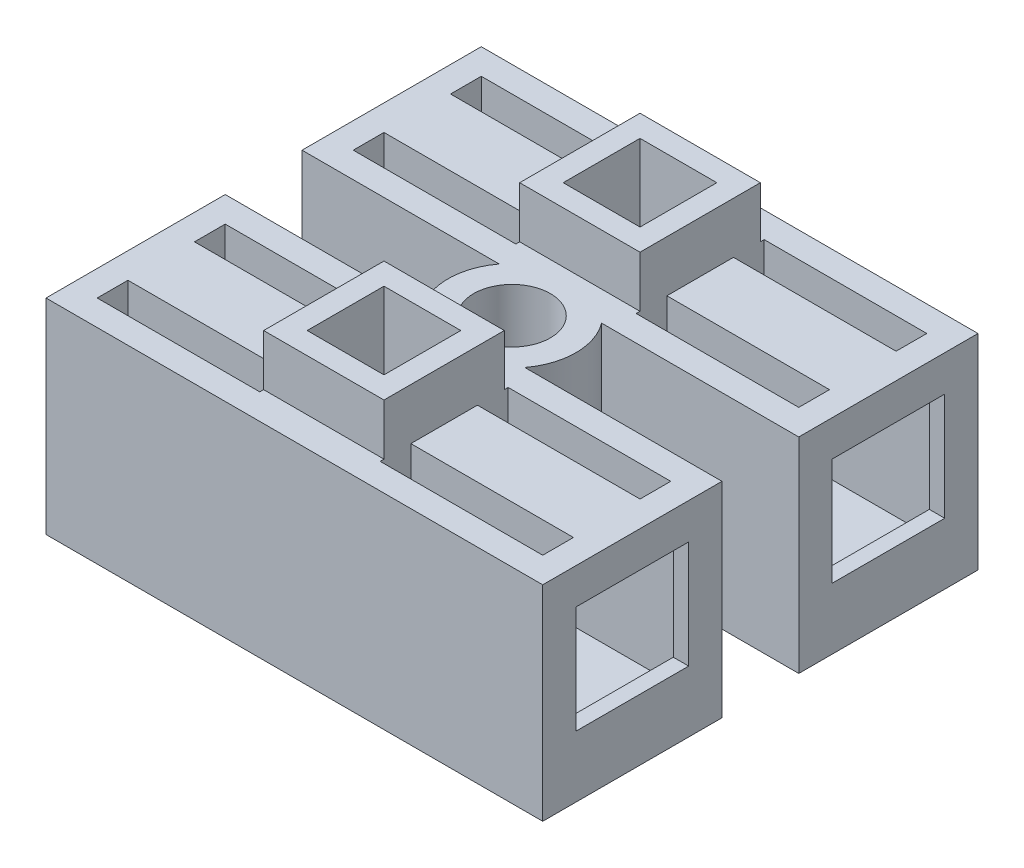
ISO-10303-21;
HEADER;
FILE_DESCRIPTION(('STEP AP214'),'2;1');
FILE_NAME('part.step','',(''),(''),'','','');
FILE_SCHEMA(('AUTOMOTIVE_DESIGN { 1 0 10303 214 1 1 1 1 }'));
ENDSEC;
DATA;
#1=APPLICATION_CONTEXT('core data for automotive mechanical design processes');
#2=APPLICATION_PROTOCOL_DEFINITION('international standard','automotive_design',2000,#1);
#3=PRODUCT_CONTEXT('',#1,'mechanical');
#4=PRODUCT('Part','Part','',(#3));
#5=PRODUCT_RELATED_PRODUCT_CATEGORY('part','',(#4));
#6=PRODUCT_DEFINITION_FORMATION('','',#4);
#7=PRODUCT_DEFINITION_CONTEXT('part definition',#1,'design');
#8=PRODUCT_DEFINITION('design','',#6,#7);
#9=PRODUCT_DEFINITION_SHAPE('','',#8);
#10=(LENGTH_UNIT() NAMED_UNIT(*) SI_UNIT(.MILLI.,.METRE.));
#11=(NAMED_UNIT(*) PLANE_ANGLE_UNIT() SI_UNIT($,.RADIAN.));
#12=(NAMED_UNIT(*) SI_UNIT($,.STERADIAN.) SOLID_ANGLE_UNIT());
#13=UNCERTAINTY_MEASURE_WITH_UNIT(LENGTH_MEASURE(1.E-05),#10,'distance_accuracy_value','');
#14=(GEOMETRIC_REPRESENTATION_CONTEXT(3) GLOBAL_UNCERTAINTY_ASSIGNED_CONTEXT((#13)) GLOBAL_UNIT_ASSIGNED_CONTEXT((#10,
#11,#12)) REPRESENTATION_CONTEXT('',''));
#15=CARTESIAN_POINT('',(0.,0.,0.));
#16=DIRECTION('',(0.,0.,1.));
#17=DIRECTION('',(1.,0.,0.));
#18=AXIS2_PLACEMENT_3D('',#15,#16,#17);
#19=CARTESIAN_POINT('',(0.,-4.,0.));
#20=DIRECTION('',(0.,1.,0.));
#21=DIRECTION('',(0.,0.,1.));
#22=AXIS2_PLACEMENT_3D('',#19,#20,#21);
#23=PLANE('',#22);
#24=CARTESIAN_POINT('',(0.,-4.,0.));
#25=DIRECTION('',(0.,1.,0.));
#26=DIRECTION('',(0.,0.,1.));
#27=AXIS2_PLACEMENT_3D('',#24,#25,#26);
#28=CIRCLE('',#27,1.5);
#29=CARTESIAN_POINT('',(0.,-4.,1.5));
#30=VERTEX_POINT('',#29);
#31=EDGE_CURVE('E881',#30,#30,#28,.F.);
#32=ORIENTED_EDGE('',*,*,#31,.F.);
#33=EDGE_LOOP('',(#32));
#34=FACE_BOUND('',#33,.T.);
#35=DIRECTION('',(0.,0.,-1.));
#36=VECTOR('',#35,1.);
#37=CARTESIAN_POINT('',(-8.7,-4.,-2.5));
#38=LINE('',#37,#36);
#39=CARTESIAN_POINT('',(-8.7,-4.,-2.5));
#40=VERTEX_POINT('',#39);
#41=CARTESIAN_POINT('',(-8.7,-4.,-7.5));
#42=VERTEX_POINT('',#41);
#43=EDGE_CURVE('E902',#40,#42,#38,.T.);
#44=ORIENTED_EDGE('',*,*,#43,.F.);
#45=DIRECTION('',(-1.,0.,0.));
#46=VECTOR('',#45,1.);
#47=CARTESIAN_POINT('',(8.7,-4.,-2.5));
#48=LINE('',#47,#46);
#49=CARTESIAN_POINT('',(8.7,-4.,-2.5));
#50=VERTEX_POINT('',#49);
#51=EDGE_CURVE('E915',#50,#40,#48,.T.);
#52=ORIENTED_EDGE('',*,*,#51,.F.);
#53=DIRECTION('',(0.,0.,1.));
#54=VECTOR('',#53,1.);
#55=CARTESIAN_POINT('',(8.7,-4.,-7.5));
#56=LINE('',#55,#54);
#57=CARTESIAN_POINT('',(8.7,-4.,-7.5));
#58=VERTEX_POINT('',#57);
#59=EDGE_CURVE('E912',#58,#50,#56,.T.);
#60=ORIENTED_EDGE('',*,*,#59,.F.);
#61=DIRECTION('',(1.,0.,0.));
#62=VECTOR('',#61,1.);
#63=CARTESIAN_POINT('',(-8.7,-4.,-7.5));
#64=LINE('',#63,#62);
#65=EDGE_CURVE('E897',#42,#58,#64,.T.);
#66=ORIENTED_EDGE('',*,*,#65,.F.);
#67=EDGE_LOOP('',(#44,#52,#60,#66));
#68=FACE_BOUND('',#67,.T.);
#69=DIRECTION('',(-1.,0.,0.));
#70=VECTOR('',#69,1.);
#71=CARTESIAN_POINT('',(-9.7,-4.,8.5));
#72=LINE('',#71,#70);
#73=CARTESIAN_POINT('',(9.7,-4.,8.5));
#74=VERTEX_POINT('',#73);
#75=CARTESIAN_POINT('',(-9.7,-4.,8.5));
#76=VERTEX_POINT('',#75);
#77=EDGE_CURVE('E844',#74,#76,#72,.T.);
#78=ORIENTED_EDGE('',*,*,#77,.T.);
#79=DIRECTION('',(0.,0.,-1.));
#80=VECTOR('',#79,1.);
#81=CARTESIAN_POINT('',(-9.7,-4.,8.5));
#82=LINE('',#81,#80);
#83=CARTESIAN_POINT('',(-9.7,-4.,1.5));
#84=VERTEX_POINT('',#83);
#85=EDGE_CURVE('E858',#76,#84,#82,.T.);
#86=ORIENTED_EDGE('',*,*,#85,.T.);
#87=DIRECTION('',(1.,0.,0.));
#88=VECTOR('',#87,1.);
#89=CARTESIAN_POINT('',(-9.7,-4.,1.5));
#90=LINE('',#89,#88);
#91=CARTESIAN_POINT('',(-2.,-4.,1.5));
#92=VERTEX_POINT('',#91);
#93=EDGE_CURVE('E856',#84,#92,#90,.T.);
#94=ORIENTED_EDGE('',*,*,#93,.T.);
#95=CARTESIAN_POINT('',(0.,-4.,0.));
#96=DIRECTION('',(0.,1.,0.));
#97=DIRECTION('',(0.,0.,1.));
#98=AXIS2_PLACEMENT_3D('',#95,#96,#97);
#99=CIRCLE('',#98,2.5);
#100=CARTESIAN_POINT('',(-2.,-4.,-1.5));
#101=VERTEX_POINT('',#100);
#102=EDGE_CURVE('E877',#92,#101,#99,.F.);
#103=ORIENTED_EDGE('',*,*,#102,.T.);
#104=DIRECTION('',(1.,0.,0.));
#105=VECTOR('',#104,1.);
#106=CARTESIAN_POINT('',(-9.7,-4.,-1.5));
#107=LINE('',#106,#105);
#108=CARTESIAN_POINT('',(-9.7,-4.,-1.5));
#109=VERTEX_POINT('',#108);
#110=EDGE_CURVE('E1180',#109,#101,#107,.T.);
#111=ORIENTED_EDGE('',*,*,#110,.F.);
#112=DIRECTION('',(0.,0.,1.));
#113=VECTOR('',#112,1.);
#114=CARTESIAN_POINT('',(-9.7,-4.,-8.5));
#115=LINE('',#114,#113);
#116=CARTESIAN_POINT('',(-9.7,-4.,-8.5));
#117=VERTEX_POINT('',#116);
#118=EDGE_CURVE('E1193',#117,#109,#115,.T.);
#119=ORIENTED_EDGE('',*,*,#118,.F.);
#120=DIRECTION('',(-1.,0.,0.));
#121=VECTOR('',#120,1.);
#122=CARTESIAN_POINT('',(-9.7,-4.,-8.5));
#123=LINE('',#122,#121);
#124=CARTESIAN_POINT('',(9.7,-4.,-8.5));
#125=VERTEX_POINT('',#124);
#126=EDGE_CURVE('E1191',#125,#117,#123,.T.);
#127=ORIENTED_EDGE('',*,*,#126,.F.);
#128=DIRECTION('',(0.,0.,-1.));
#129=VECTOR('',#128,1.);
#130=CARTESIAN_POINT('',(9.7,-4.,-8.5));
#131=LINE('',#130,#129);
#132=CARTESIAN_POINT('',(9.7,-4.,-1.5));
#133=VERTEX_POINT('',#132);
#134=EDGE_CURVE('E1164',#133,#125,#131,.T.);
#135=ORIENTED_EDGE('',*,*,#134,.F.);
#136=CARTESIAN_POINT('',(2.,-4.,-1.5));
#137=VERTEX_POINT('',#136);
#138=EDGE_CURVE('E1195',#137,#133,#107,.T.);
#139=ORIENTED_EDGE('',*,*,#138,.F.);
#140=CARTESIAN_POINT('',(2.,-4.,1.5));
#141=VERTEX_POINT('',#140);
#142=EDGE_CURVE('E878',#137,#141,#99,.F.);
#143=ORIENTED_EDGE('',*,*,#142,.T.);
#144=CARTESIAN_POINT('',(9.7,-4.,1.5));
#145=VERTEX_POINT('',#144);
#146=EDGE_CURVE('E855',#141,#145,#90,.T.);
#147=ORIENTED_EDGE('',*,*,#146,.T.);
#148=DIRECTION('',(0.,0.,1.));
#149=VECTOR('',#148,1.);
#150=CARTESIAN_POINT('',(9.7,-4.,8.5));
#151=LINE('',#150,#149);
#152=EDGE_CURVE('E827',#145,#74,#151,.T.);
#153=ORIENTED_EDGE('',*,*,#152,.T.);
#154=EDGE_LOOP('',(#78,#86,#94,#103,#111,#119,#127,#135,#139,#143,#147,#153));
#155=FACE_BOUND('',#154,.T.);
#156=DIRECTION('',(1.,0.,0.));
#157=VECTOR('',#156,1.);
#158=CARTESIAN_POINT('',(-8.7,-4.,7.5));
#159=LINE('',#158,#157);
#160=CARTESIAN_POINT('',(-8.7,-4.,7.5));
#161=VERTEX_POINT('',#160);
#162=CARTESIAN_POINT('',(8.7,-4.,7.5));
#163=VERTEX_POINT('',#162);
#164=EDGE_CURVE('E51',#161,#163,#159,.T.);
#165=ORIENTED_EDGE('',*,*,#164,.T.);
#166=DIRECTION('',(0.,0.,-1.));
#167=VECTOR('',#166,1.);
#168=CARTESIAN_POINT('',(8.7,-4.,7.5));
#169=LINE('',#168,#167);
#170=CARTESIAN_POINT('',(8.7,-4.,2.5));
#171=VERTEX_POINT('',#170);
#172=EDGE_CURVE('E576',#163,#171,#169,.T.);
#173=ORIENTED_EDGE('',*,*,#172,.T.);
#174=DIRECTION('',(-1.,0.,0.));
#175=VECTOR('',#174,1.);
#176=CARTESIAN_POINT('',(8.7,-4.,2.5));
#177=LINE('',#176,#175);
#178=CARTESIAN_POINT('',(-8.7,-4.,2.5));
#179=VERTEX_POINT('',#178);
#180=EDGE_CURVE('E579',#171,#179,#177,.T.);
#181=ORIENTED_EDGE('',*,*,#180,.T.);
#182=DIRECTION('',(0.,0.,1.));
#183=VECTOR('',#182,1.);
#184=CARTESIAN_POINT('',(-8.7,-4.,2.5));
#185=LINE('',#184,#183);
#186=EDGE_CURVE('E585',#179,#161,#185,.T.);
#187=ORIENTED_EDGE('',*,*,#186,.T.);
#188=EDGE_LOOP('',(#165,#173,#181,#187));
#189=FACE_BOUND('',#188,.T.);
#190=ADVANCED_FACE('F36',(#34,#68,#155,#189),#23,.F.);
#191=CARTESIAN_POINT('',(-9.7,2.8,2.5));
#192=DIRECTION('',(0.,-1.,0.));
#193=DIRECTION('',(0.,0.,-1.));
#194=AXIS2_PLACEMENT_3D('',#191,#192,#193);
#195=PLANE('',#194);
#196=DIRECTION('',(0.,0.,-1.));
#197=VECTOR('',#196,1.);
#198=CARTESIAN_POINT('',(-1.5,2.8,6.5));
#199=LINE('',#198,#197);
#200=CARTESIAN_POINT('',(-1.5,2.8,6.5));
#201=VERTEX_POINT('',#200);
#202=CARTESIAN_POINT('',(-1.5,2.8,3.5));
#203=VERTEX_POINT('',#202);
#204=EDGE_CURVE('E749',#201,#203,#199,.T.);
#205=ORIENTED_EDGE('',*,*,#204,.F.);
#206=DIRECTION('',(-1.,0.,0.));
#207=VECTOR('',#206,1.);
#208=CARTESIAN_POINT('',(1.5,2.8,6.5));
#209=LINE('',#208,#207);
#210=CARTESIAN_POINT('',(1.5,2.8,6.5));
#211=VERTEX_POINT('',#210);
#212=EDGE_CURVE('E752',#211,#201,#209,.T.);
#213=ORIENTED_EDGE('',*,*,#212,.F.);
#214=DIRECTION('',(0.,0.,1.));
#215=VECTOR('',#214,1.);
#216=CARTESIAN_POINT('',(1.5,2.8,3.5));
#217=LINE('',#216,#215);
#218=CARTESIAN_POINT('',(1.5,2.8,3.5));
#219=VERTEX_POINT('',#218);
#220=EDGE_CURVE('E770',#219,#211,#217,.T.);
#221=ORIENTED_EDGE('',*,*,#220,.F.);
#222=DIRECTION('',(1.,0.,0.));
#223=VECTOR('',#222,1.);
#224=CARTESIAN_POINT('',(-1.5,2.8,3.5));
#225=LINE('',#224,#223);
#226=EDGE_CURVE('E743',#203,#219,#225,.T.);
#227=ORIENTED_EDGE('',*,*,#226,.F.);
#228=EDGE_LOOP('',(#205,#213,#221,#227));
#229=FACE_BOUND('',#228,.T.);
#230=DIRECTION('',(1.,0.,0.));
#231=VECTOR('',#230,1.);
#232=CARTESIAN_POINT('',(-9.7,2.8,2.5));
#233=LINE('',#232,#231);
#234=CARTESIAN_POINT('',(8.7,2.8,2.5));
#235=VERTEX_POINT('',#234);
#236=CARTESIAN_POINT('',(9.1,2.8,2.5));
#237=VERTEX_POINT('',#236);
#238=EDGE_CURVE('E834',#235,#237,#233,.T.);
#239=ORIENTED_EDGE('',*,*,#238,.T.);
#240=DIRECTION('',(0.,0.,1.));
#241=VECTOR('',#240,1.);
#242=CARTESIAN_POINT('',(9.1,2.8,2.50000000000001));
#243=LINE('',#242,#241);
#244=CARTESIAN_POINT('',(9.1,2.8,7.5));
#245=VERTEX_POINT('',#244);
#246=EDGE_CURVE('E629',#237,#245,#243,.T.);
#247=ORIENTED_EDGE('',*,*,#246,.T.);
#248=DIRECTION('',(1.,0.,0.));
#249=VECTOR('',#248,1.);
#250=CARTESIAN_POINT('',(-9.7,2.8,7.5));
#251=LINE('',#250,#249);
#252=CARTESIAN_POINT('',(8.69999999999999,2.8,7.5));
#253=VERTEX_POINT('',#252);
#254=EDGE_CURVE('E829',#253,#245,#251,.T.);
#255=ORIENTED_EDGE('',*,*,#254,.F.);
#256=DIRECTION('',(0.,0.,-1.));
#257=VECTOR('',#256,1.);
#258=CARTESIAN_POINT('',(8.7,2.8,6.3));
#259=LINE('',#258,#257);
#260=CARTESIAN_POINT('',(8.7,2.8,6.3));
#261=VERTEX_POINT('',#260);
#262=EDGE_CURVE('E682',#253,#261,#259,.T.);
#263=ORIENTED_EDGE('',*,*,#262,.T.);
#264=DIRECTION('',(-1.,0.,0.));
#265=VECTOR('',#264,1.);
#266=CARTESIAN_POINT('',(2.35,2.8,6.3));
#267=LINE('',#266,#265);
#268=CARTESIAN_POINT('',(2.35,2.8,6.3));
#269=VERTEX_POINT('',#268);
#270=EDGE_CURVE('E678',#261,#269,#267,.T.);
#271=ORIENTED_EDGE('',*,*,#270,.T.);
#272=DIRECTION('',(0.,0.,1.));
#273=VECTOR('',#272,1.);
#274=CARTESIAN_POINT('',(2.35,2.8,6.3));
#275=LINE('',#274,#273);
#276=CARTESIAN_POINT('',(2.35,2.8,7.5));
#277=VERTEX_POINT('',#276);
#278=EDGE_CURVE('E656',#269,#277,#275,.T.);
#279=ORIENTED_EDGE('',*,*,#278,.T.);
#280=CARTESIAN_POINT('',(-2.35,2.8,7.5));
#281=VERTEX_POINT('',#280);
#282=EDGE_CURVE('E828',#281,#277,#251,.T.);
#283=ORIENTED_EDGE('',*,*,#282,.F.);
#284=DIRECTION('',(0.,0.,1.));
#285=VECTOR('',#284,1.);
#286=CARTESIAN_POINT('',(-2.35,2.8,6.3));
#287=LINE('',#286,#285);
#288=CARTESIAN_POINT('',(-2.35,2.8,6.3));
#289=VERTEX_POINT('',#288);
#290=EDGE_CURVE('E723',#289,#281,#287,.T.);
#291=ORIENTED_EDGE('',*,*,#290,.F.);
#292=DIRECTION('',(1.,0.,0.));
#293=VECTOR('',#292,1.);
#294=CARTESIAN_POINT('',(-2.35,2.8,6.3));
#295=LINE('',#294,#293);
#296=CARTESIAN_POINT('',(-8.7,2.8,6.3));
#297=VERTEX_POINT('',#296);
#298=EDGE_CURVE('E720',#297,#289,#295,.T.);
#299=ORIENTED_EDGE('',*,*,#298,.F.);
#300=DIRECTION('',(0.,0.,-1.));
#301=VECTOR('',#300,1.);
#302=CARTESIAN_POINT('',(-8.7,2.8,6.3));
#303=LINE('',#302,#301);
#304=CARTESIAN_POINT('',(-8.7,2.8,7.5));
#305=VERTEX_POINT('',#304);
#306=EDGE_CURVE('E740',#305,#297,#303,.T.);
#307=ORIENTED_EDGE('',*,*,#306,.F.);
#308=CARTESIAN_POINT('',(-9.7,2.8,7.5));
#309=VERTEX_POINT('',#308);
#310=EDGE_CURVE('E824',#309,#305,#251,.T.);
#311=ORIENTED_EDGE('',*,*,#310,.F.);
#312=DIRECTION('',(0.,0.,-1.));
#313=VECTOR('',#312,1.);
#314=CARTESIAN_POINT('',(-9.7,2.8,2.5));
#315=LINE('',#314,#313);
#316=CARTESIAN_POINT('',(-9.7,2.8,2.5));
#317=VERTEX_POINT('',#316);
#318=EDGE_CURVE('E821',#309,#317,#315,.T.);
#319=ORIENTED_EDGE('',*,*,#318,.T.);
#320=CARTESIAN_POINT('',(-8.7,2.8,2.5));
#321=VERTEX_POINT('',#320);
#322=EDGE_CURVE('E830',#317,#321,#233,.T.);
#323=ORIENTED_EDGE('',*,*,#322,.T.);
#324=DIRECTION('',(0.,0.,1.));
#325=VECTOR('',#324,1.);
#326=CARTESIAN_POINT('',(-8.7,2.8,3.7));
#327=LINE('',#326,#325);
#328=CARTESIAN_POINT('',(-8.7,2.8,3.7));
#329=VERTEX_POINT('',#328);
#330=EDGE_CURVE('E711',#321,#329,#327,.T.);
#331=ORIENTED_EDGE('',*,*,#330,.T.);
#332=DIRECTION('',(1.,0.,0.));
#333=VECTOR('',#332,1.);
#334=CARTESIAN_POINT('',(-2.35,2.8,3.7));
#335=LINE('',#334,#333);
#336=CARTESIAN_POINT('',(-2.35,2.8,3.7));
#337=VERTEX_POINT('',#336);
#338=EDGE_CURVE('E707',#329,#337,#335,.T.);
#339=ORIENTED_EDGE('',*,*,#338,.T.);
#340=DIRECTION('',(0.,0.,-1.));
#341=VECTOR('',#340,1.);
#342=CARTESIAN_POINT('',(-2.35,2.8,3.7));
#343=LINE('',#342,#341);
#344=CARTESIAN_POINT('',(-2.35,2.8,2.5));
#345=VERTEX_POINT('',#344);
#346=EDGE_CURVE('E664',#337,#345,#343,.T.);
#347=ORIENTED_EDGE('',*,*,#346,.T.);
#348=CARTESIAN_POINT('',(2.35,2.8,2.5));
#349=VERTEX_POINT('',#348);
#350=EDGE_CURVE('E833',#345,#349,#233,.T.);
#351=ORIENTED_EDGE('',*,*,#350,.T.);
#352=DIRECTION('',(0.,0.,-1.));
#353=VECTOR('',#352,1.);
#354=CARTESIAN_POINT('',(2.35,2.8,3.7));
#355=LINE('',#354,#353);
#356=CARTESIAN_POINT('',(2.35,2.8,3.7));
#357=VERTEX_POINT('',#356);
#358=EDGE_CURVE('E636',#357,#349,#355,.T.);
#359=ORIENTED_EDGE('',*,*,#358,.F.);
#360=DIRECTION('',(-1.,0.,0.));
#361=VECTOR('',#360,1.);
#362=CARTESIAN_POINT('',(2.35,2.8,3.7));
#363=LINE('',#362,#361);
#364=CARTESIAN_POINT('',(8.7,2.8,3.7));
#365=VERTEX_POINT('',#364);
#366=EDGE_CURVE('E633',#365,#357,#363,.T.);
#367=ORIENTED_EDGE('',*,*,#366,.F.);
#368=DIRECTION('',(0.,0.,1.));
#369=VECTOR('',#368,1.);
#370=CARTESIAN_POINT('',(8.7,2.8,3.7));
#371=LINE('',#370,#369);
#372=EDGE_CURVE('E653',#235,#365,#371,.T.);
#373=ORIENTED_EDGE('',*,*,#372,.F.);
#374=EDGE_LOOP('',(#239,#247,#255,#263,#271,#279,#283,#291,#299,#307,#311,#319,#323,#331,#339,
#347,#351,#359,#367,#373));
#375=FACE_BOUND('',#374,.T.);
#376=ADVANCED_FACE('F1260',(#229,#375),#195,.T.);
#377=CARTESIAN_POINT('',(-9.7,2.8,7.5));
#378=DIRECTION('',(0.,0.,-1.));
#379=DIRECTION('',(-1.,0.,0.));
#380=AXIS2_PLACEMENT_3D('',#377,#378,#379);
#381=PLANE('',#380);
#382=ORIENTED_EDGE('',*,*,#254,.T.);
#383=DIRECTION('',(0.,-1.,0.));
#384=VECTOR('',#383,1.);
#385=CARTESIAN_POINT('',(9.1,2.8,7.5));
#386=LINE('',#385,#384);
#387=CARTESIAN_POINT('',(9.1,-2.8,7.5));
#388=VERTEX_POINT('',#387);
#389=EDGE_CURVE('E626',#245,#388,#386,.T.);
#390=ORIENTED_EDGE('',*,*,#389,.T.);
#391=DIRECTION('',(1.,0.,0.));
#392=VECTOR('',#391,1.);
#393=CARTESIAN_POINT('',(-9.7,-2.8,7.5));
#394=LINE('',#393,#392);
#395=CARTESIAN_POINT('',(-9.7,-2.8,7.5));
#396=VERTEX_POINT('',#395);
#397=EDGE_CURVE('E823',#396,#388,#394,.T.);
#398=ORIENTED_EDGE('',*,*,#397,.F.);
#399=DIRECTION('',(0.,1.,0.));
#400=VECTOR('',#399,1.);
#401=CARTESIAN_POINT('',(-9.7,2.8,7.5));
#402=LINE('',#401,#400);
#403=EDGE_CURVE('E814',#396,#309,#402,.T.);
#404=ORIENTED_EDGE('',*,*,#403,.T.);
#405=ORIENTED_EDGE('',*,*,#310,.T.);
#406=DIRECTION('',(0.,1.,0.));
#407=VECTOR('',#406,1.);
#408=CARTESIAN_POINT('',(-8.7,-4.001,7.5));
#409=LINE('',#408,#407);
#410=CARTESIAN_POINT('',(-8.7,4.,7.5));
#411=VERTEX_POINT('',#410);
#412=EDGE_CURVE('E728',#305,#411,#409,.T.);
#413=ORIENTED_EDGE('',*,*,#412,.T.);
#414=DIRECTION('',(-1.,0.,0.));
#415=VECTOR('',#414,1.);
#416=CARTESIAN_POINT('',(-2.35,4.,7.5));
#417=LINE('',#416,#415);
#418=CARTESIAN_POINT('',(-2.35,4.,7.5));
#419=VERTEX_POINT('',#418);
#420=EDGE_CURVE('E725',#419,#411,#417,.T.);
#421=ORIENTED_EDGE('',*,*,#420,.F.);
#422=DIRECTION('',(0.,1.,0.));
#423=VECTOR('',#422,1.);
#424=CARTESIAN_POINT('',(-2.35,-4.001,7.5));
#425=LINE('',#424,#423);
#426=EDGE_CURVE('E729',#281,#419,#425,.T.);
#427=ORIENTED_EDGE('',*,*,#426,.F.);
#428=ORIENTED_EDGE('',*,*,#282,.T.);
#429=DIRECTION('',(0.,1.,0.));
#430=VECTOR('',#429,1.);
#431=CARTESIAN_POINT('',(2.35,-4.001,7.5));
#432=LINE('',#431,#430);
#433=CARTESIAN_POINT('',(2.35,4.,7.5));
#434=VERTEX_POINT('',#433);
#435=EDGE_CURVE('E677',#277,#434,#432,.T.);
#436=ORIENTED_EDGE('',*,*,#435,.T.);
#437=DIRECTION('',(1.,0.,0.));
#438=VECTOR('',#437,1.);
#439=CARTESIAN_POINT('',(2.35,4.,7.5));
#440=LINE('',#439,#438);
#441=CARTESIAN_POINT('',(8.7,4.,7.5));
#442=VERTEX_POINT('',#441);
#443=EDGE_CURVE('E668',#434,#442,#440,.T.);
#444=ORIENTED_EDGE('',*,*,#443,.T.);
#445=DIRECTION('',(0.,1.,0.));
#446=VECTOR('',#445,1.);
#447=CARTESIAN_POINT('',(8.7,-4.001,7.5));
#448=LINE('',#447,#446);
#449=EDGE_CURVE('E674',#253,#442,#448,.T.);
#450=ORIENTED_EDGE('',*,*,#449,.F.);
#451=EDGE_LOOP('',(#382,#390,#398,#404,#405,#413,#421,#427,#428,#436,#444,#450));
#452=FACE_BOUND('',#451,.T.);
#453=ADVANCED_FACE('F1266',(#452),#381,.T.);
#454=CARTESIAN_POINT('',(-9.7,2.8,2.5));
#455=DIRECTION('',(0.,0.,1.));
#456=DIRECTION('',(1.,0.,0.));
#457=AXIS2_PLACEMENT_3D('',#454,#455,#456);
#458=PLANE('',#457);
#459=DIRECTION('',(1.,0.,0.));
#460=VECTOR('',#459,1.);
#461=CARTESIAN_POINT('',(-9.7,-2.8,2.5));
#462=LINE('',#461,#460);
#463=CARTESIAN_POINT('',(-9.7,-2.8,2.5));
#464=VERTEX_POINT('',#463);
#465=CARTESIAN_POINT('',(9.1,-2.8,2.5));
#466=VERTEX_POINT('',#465);
#467=EDGE_CURVE('E835',#464,#466,#462,.T.);
#468=ORIENTED_EDGE('',*,*,#467,.T.);
#469=DIRECTION('',(0.,1.,0.));
#470=VECTOR('',#469,1.);
#471=CARTESIAN_POINT('',(9.1,2.8,2.5));
#472=LINE('',#471,#470);
#473=EDGE_CURVE('E59',#466,#237,#472,.T.);
#474=ORIENTED_EDGE('',*,*,#473,.T.);
#475=ORIENTED_EDGE('',*,*,#238,.F.);
#476=DIRECTION('',(0.,1.,0.));
#477=VECTOR('',#476,1.);
#478=CARTESIAN_POINT('',(8.7,-4.001,2.5));
#479=LINE('',#478,#477);
#480=CARTESIAN_POINT('',(8.7,4.,2.5));
#481=VERTEX_POINT('',#480);
#482=EDGE_CURVE('E641',#235,#481,#479,.T.);
#483=ORIENTED_EDGE('',*,*,#482,.T.);
#484=DIRECTION('',(1.,0.,0.));
#485=VECTOR('',#484,1.);
#486=CARTESIAN_POINT('',(2.35,4.,2.5));
#487=LINE('',#486,#485);
#488=CARTESIAN_POINT('',(2.35,4.,2.5));
#489=VERTEX_POINT('',#488);
#490=EDGE_CURVE('E638',#489,#481,#487,.T.);
#491=ORIENTED_EDGE('',*,*,#490,.F.);
#492=DIRECTION('',(0.,1.,0.));
#493=VECTOR('',#492,1.);
#494=CARTESIAN_POINT('',(2.35,-4.001,2.5));
#495=LINE('',#494,#493);
#496=EDGE_CURVE('E642',#349,#489,#495,.T.);
#497=ORIENTED_EDGE('',*,*,#496,.F.);
#498=ORIENTED_EDGE('',*,*,#350,.F.);
#499=DIRECTION('',(0.,1.,0.));
#500=VECTOR('',#499,1.);
#501=CARTESIAN_POINT('',(-2.35,-4.001,2.5));
#502=LINE('',#501,#500);
#503=CARTESIAN_POINT('',(-2.35,4.,2.5));
#504=VERTEX_POINT('',#503);
#505=EDGE_CURVE('E706',#345,#504,#502,.T.);
#506=ORIENTED_EDGE('',*,*,#505,.T.);
#507=DIRECTION('',(-1.,0.,0.));
#508=VECTOR('',#507,1.);
#509=CARTESIAN_POINT('',(-2.35,4.,2.5));
#510=LINE('',#509,#508);
#511=CARTESIAN_POINT('',(-8.7,4.,2.5));
#512=VERTEX_POINT('',#511);
#513=EDGE_CURVE('E697',#504,#512,#510,.T.);
#514=ORIENTED_EDGE('',*,*,#513,.T.);
#515=DIRECTION('',(0.,1.,0.));
#516=VECTOR('',#515,1.);
#517=CARTESIAN_POINT('',(-8.7,-4.001,2.5));
#518=LINE('',#517,#516);
#519=EDGE_CURVE('E703',#321,#512,#518,.T.);
#520=ORIENTED_EDGE('',*,*,#519,.F.);
#521=ORIENTED_EDGE('',*,*,#322,.F.);
#522=DIRECTION('',(0.,-1.,0.));
#523=VECTOR('',#522,1.);
#524=CARTESIAN_POINT('',(-9.7,2.8,2.5));
#525=LINE('',#524,#523);
#526=EDGE_CURVE('E818',#317,#464,#525,.T.);
#527=ORIENTED_EDGE('',*,*,#526,.T.);
#528=EDGE_LOOP('',(#468,#474,#475,#483,#491,#497,#498,#506,#514,#520,#521,#527));
#529=FACE_BOUND('',#528,.T.);
#530=ADVANCED_FACE('F1752',(#529),#458,.T.);
#531=CARTESIAN_POINT('',(-9.7,-2.8,2.5));
#532=DIRECTION('',(0.,1.,0.));
#533=DIRECTION('',(0.,0.,1.));
#534=AXIS2_PLACEMENT_3D('',#531,#532,#533);
#535=PLANE('',#534);
#536=ORIENTED_EDGE('',*,*,#397,.T.);
#537=DIRECTION('',(0.,0.,-1.));
#538=VECTOR('',#537,1.);
#539=CARTESIAN_POINT('',(9.1,-2.8,2.50000000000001));
#540=LINE('',#539,#538);
#541=EDGE_CURVE('E11',#388,#466,#540,.T.);
#542=ORIENTED_EDGE('',*,*,#541,.T.);
#543=ORIENTED_EDGE('',*,*,#467,.F.);
#544=DIRECTION('',(0.,0.,1.));
#545=VECTOR('',#544,1.);
#546=CARTESIAN_POINT('',(-9.7,-2.8,2.5));
#547=LINE('',#546,#545);
#548=EDGE_CURVE('E816',#464,#396,#547,.T.);
#549=ORIENTED_EDGE('',*,*,#548,.T.);
#550=EDGE_LOOP('',(#536,#542,#543,#549));
#551=FACE_BOUND('',#550,.T.);
#552=ADVANCED_FACE('F1763',(#551),#535,.T.);
#553=CARTESIAN_POINT('',(0.,4.,0.));
#554=DIRECTION('',(0.,1.,0.));
#555=DIRECTION('',(0.,0.,1.));
#556=AXIS2_PLACEMENT_3D('',#553,#554,#555);
#557=PLANE('',#556);
#558=DIRECTION('',(0.,0.,1.));
#559=VECTOR('',#558,1.);
#560=CARTESIAN_POINT('',(9.7,4.,8.5));
#561=LINE('',#560,#559);
#562=CARTESIAN_POINT('',(9.7,4.,1.5));
#563=VERTEX_POINT('',#562);
#564=CARTESIAN_POINT('',(9.7,4.,8.5));
#565=VERTEX_POINT('',#564);
#566=EDGE_CURVE('E840',#563,#565,#561,.T.);
#567=ORIENTED_EDGE('',*,*,#566,.F.);
#568=DIRECTION('',(1.,0.,0.));
#569=VECTOR('',#568,1.);
#570=CARTESIAN_POINT('',(-9.7,4.,1.5));
#571=LINE('',#570,#569);
#572=CARTESIAN_POINT('',(2.,4.,1.5));
#573=VERTEX_POINT('',#572);
#574=EDGE_CURVE('E843',#573,#563,#571,.T.);
#575=ORIENTED_EDGE('',*,*,#574,.F.);
#576=CARTESIAN_POINT('',(0.,4.,0.));
#577=DIRECTION('',(0.,1.,0.));
#578=DIRECTION('',(0.,0.,1.));
#579=AXIS2_PLACEMENT_3D('',#576,#577,#578);
#580=CIRCLE('',#579,2.5);
#581=CARTESIAN_POINT('',(2.,4.,-1.5));
#582=VERTEX_POINT('',#581);
#583=EDGE_CURVE('E889',#573,#582,#580,.T.);
#584=ORIENTED_EDGE('',*,*,#583,.T.);
#585=DIRECTION('',(1.,0.,0.));
#586=VECTOR('',#585,1.);
#587=CARTESIAN_POINT('',(-9.7,4.,-1.5));
#588=LINE('',#587,#586);
#589=CARTESIAN_POINT('',(9.7,4.,-1.5));
#590=VERTEX_POINT('',#589);
#591=EDGE_CURVE('E1184',#582,#590,#588,.T.);
#592=ORIENTED_EDGE('',*,*,#591,.T.);
#593=DIRECTION('',(0.,0.,-1.));
#594=VECTOR('',#593,1.);
#595=CARTESIAN_POINT('',(9.7,4.,-8.5));
#596=LINE('',#595,#594);
#597=CARTESIAN_POINT('',(9.7,4.,-8.5));
#598=VERTEX_POINT('',#597);
#599=EDGE_CURVE('E1176',#590,#598,#596,.T.);
#600=ORIENTED_EDGE('',*,*,#599,.T.);
#601=DIRECTION('',(-1.,0.,0.));
#602=VECTOR('',#601,1.);
#603=CARTESIAN_POINT('',(-9.7,4.,-8.5));
#604=LINE('',#603,#602);
#605=CARTESIAN_POINT('',(-9.7,4.,-8.5));
#606=VERTEX_POINT('',#605);
#607=EDGE_CURVE('E1179',#598,#606,#604,.T.);
#608=ORIENTED_EDGE('',*,*,#607,.T.);
#609=DIRECTION('',(0.,0.,1.));
#610=VECTOR('',#609,1.);
#611=CARTESIAN_POINT('',(-9.7,4.,-8.5));
#612=LINE('',#611,#610);
#613=CARTESIAN_POINT('',(-9.7,4.,-1.5));
#614=VERTEX_POINT('',#613);
#615=EDGE_CURVE('E1182',#606,#614,#612,.T.);
#616=ORIENTED_EDGE('',*,*,#615,.T.);
#617=CARTESIAN_POINT('',(-2.,4.,-1.5));
#618=VERTEX_POINT('',#617);
#619=EDGE_CURVE('E1185',#614,#618,#588,.T.);
#620=ORIENTED_EDGE('',*,*,#619,.T.);
#621=CARTESIAN_POINT('',(-2.,4.,1.5));
#622=VERTEX_POINT('',#621);
#623=EDGE_CURVE('E885',#618,#622,#580,.T.);
#624=ORIENTED_EDGE('',*,*,#623,.T.);
#625=CARTESIAN_POINT('',(-9.7,4.,1.5));
#626=VERTEX_POINT('',#625);
#627=EDGE_CURVE('E845',#626,#622,#571,.T.);
#628=ORIENTED_EDGE('',*,*,#627,.F.);
#629=DIRECTION('',(0.,0.,-1.));
#630=VECTOR('',#629,1.);
#631=CARTESIAN_POINT('',(-9.7,4.,8.5));
#632=LINE('',#631,#630);
#633=CARTESIAN_POINT('',(-9.7,4.,8.5));
#634=VERTEX_POINT('',#633);
#635=EDGE_CURVE('E847',#634,#626,#632,.T.);
#636=ORIENTED_EDGE('',*,*,#635,.F.);
#637=DIRECTION('',(-1.,0.,0.));
#638=VECTOR('',#637,1.);
#639=CARTESIAN_POINT('',(-9.7,4.,8.5));
#640=LINE('',#639,#638);
#641=EDGE_CURVE('E850',#565,#634,#640,.T.);
#642=ORIENTED_EDGE('',*,*,#641,.F.);
#643=EDGE_LOOP('',(#567,#575,#584,#592,#600,#608,#616,#620,#624,#628,#636,#642));
#644=FACE_BOUND('',#643,.T.);
#645=CARTESIAN_POINT('',(0.,4.,0.));
#646=DIRECTION('',(0.,1.,0.));
#647=DIRECTION('',(0.,0.,1.));
#648=AXIS2_PLACEMENT_3D('',#645,#646,#647);
#649=CIRCLE('',#648,1.5);
#650=CARTESIAN_POINT('',(0.,4.,1.5));
#651=VERTEX_POINT('',#650);
#652=EDGE_CURVE('E884',#651,#651,#649,.T.);
#653=ORIENTED_EDGE('',*,*,#652,.F.);
#654=EDGE_LOOP('',(#653));
#655=FACE_BOUND('',#654,.T.);
#656=DIRECTION('',(0.,0.,1.));
#657=VECTOR('',#656,1.);
#658=CARTESIAN_POINT('',(2.35,4.,-3.7));
#659=LINE('',#658,#657);
#660=CARTESIAN_POINT('',(2.35,4.,-2.65));
#661=VERTEX_POINT('',#660);
#662=CARTESIAN_POINT('',(2.35,4.,-2.5));
#663=VERTEX_POINT('',#662);
#664=EDGE_CURVE('E979',#661,#663,#659,.T.);
#665=ORIENTED_EDGE('',*,*,#664,.F.);
#666=DIRECTION('',(1.,0.,0.));
#667=VECTOR('',#666,1.);
#668=CARTESIAN_POINT('',(2.35,4.,-2.65));
#669=LINE('',#668,#667);
#670=CARTESIAN_POINT('',(-2.35,4.,-2.65));
#671=VERTEX_POINT('',#670);
#672=EDGE_CURVE('E1130',#671,#661,#669,.T.);
#673=ORIENTED_EDGE('',*,*,#672,.F.);
#674=DIRECTION('',(0.,0.,1.));
#675=VECTOR('',#674,1.);
#676=CARTESIAN_POINT('',(-2.35,4.,-3.7));
#677=LINE('',#676,#675);
#678=CARTESIAN_POINT('',(-2.35,4.,-2.5));
#679=VERTEX_POINT('',#678);
#680=EDGE_CURVE('E1033',#671,#679,#677,.T.);
#681=ORIENTED_EDGE('',*,*,#680,.T.);
#682=DIRECTION('',(-1.,0.,0.));
#683=VECTOR('',#682,1.);
#684=CARTESIAN_POINT('',(-2.35,4.,-2.5));
#685=LINE('',#684,#683);
#686=CARTESIAN_POINT('',(-8.7,4.,-2.5));
#687=VERTEX_POINT('',#686);
#688=EDGE_CURVE('E1042',#679,#687,#685,.T.);
#689=ORIENTED_EDGE('',*,*,#688,.T.);
#690=DIRECTION('',(0.,0.,-1.));
#691=VECTOR('',#690,1.);
#692=CARTESIAN_POINT('',(-8.7,4.,-3.7));
#693=LINE('',#692,#691);
#694=CARTESIAN_POINT('',(-8.7,4.,-3.7));
#695=VERTEX_POINT('',#694);
#696=EDGE_CURVE('E1039',#687,#695,#693,.T.);
#697=ORIENTED_EDGE('',*,*,#696,.T.);
#698=DIRECTION('',(1.,0.,0.));
#699=VECTOR('',#698,1.);
#700=CARTESIAN_POINT('',(-2.35,4.,-3.7));
#701=LINE('',#700,#699);
#702=CARTESIAN_POINT('',(-2.35,4.,-3.7));
#703=VERTEX_POINT('',#702);
#704=EDGE_CURVE('E1036',#695,#703,#701,.T.);
#705=ORIENTED_EDGE('',*,*,#704,.T.);
#706=DIRECTION('',(0.,0.,1.));
#707=VECTOR('',#706,1.);
#708=CARTESIAN_POINT('',(-2.35,4.,-7.35));
#709=LINE('',#708,#707);
#710=CARTESIAN_POINT('',(-2.35,4.,-6.3));
#711=VERTEX_POINT('',#710);
#712=EDGE_CURVE('E1116',#711,#703,#709,.T.);
#713=ORIENTED_EDGE('',*,*,#712,.F.);
#714=DIRECTION('',(1.,0.,0.));
#715=VECTOR('',#714,1.);
#716=CARTESIAN_POINT('',(-2.35,4.,-6.3));
#717=LINE('',#716,#715);
#718=CARTESIAN_POINT('',(-8.7,4.,-6.3));
#719=VERTEX_POINT('',#718);
#720=EDGE_CURVE('E1057',#719,#711,#717,.T.);
#721=ORIENTED_EDGE('',*,*,#720,.F.);
#722=DIRECTION('',(0.,0.,1.));
#723=VECTOR('',#722,1.);
#724=CARTESIAN_POINT('',(-8.7,4.,-6.3));
#725=LINE('',#724,#723);
#726=CARTESIAN_POINT('',(-8.7,4.,-7.5));
#727=VERTEX_POINT('',#726);
#728=EDGE_CURVE('E1060',#727,#719,#725,.T.);
#729=ORIENTED_EDGE('',*,*,#728,.F.);
#730=DIRECTION('',(-1.,0.,0.));
#731=VECTOR('',#730,1.);
#732=CARTESIAN_POINT('',(-2.35,4.,-7.5));
#733=LINE('',#732,#731);
#734=CARTESIAN_POINT('',(-2.35,4.,-7.5));
#735=VERTEX_POINT('',#734);
#736=EDGE_CURVE('E1063',#735,#727,#733,.T.);
#737=ORIENTED_EDGE('',*,*,#736,.F.);
#738=DIRECTION('',(0.,0.,-1.));
#739=VECTOR('',#738,1.);
#740=CARTESIAN_POINT('',(-2.35,4.,-6.3));
#741=LINE('',#740,#739);
#742=CARTESIAN_POINT('',(-2.35,4.,-7.35));
#743=VERTEX_POINT('',#742);
#744=EDGE_CURVE('E1066',#743,#735,#741,.T.);
#745=ORIENTED_EDGE('',*,*,#744,.F.);
#746=DIRECTION('',(-1.,0.,0.));
#747=VECTOR('',#746,1.);
#748=CARTESIAN_POINT('',(2.35,4.,-7.35));
#749=LINE('',#748,#747);
#750=CARTESIAN_POINT('',(2.35,4.,-7.35));
#751=VERTEX_POINT('',#750);
#752=EDGE_CURVE('E1121',#751,#743,#749,.T.);
#753=ORIENTED_EDGE('',*,*,#752,.F.);
#754=DIRECTION('',(0.,0.,-1.));
#755=VECTOR('',#754,1.);
#756=CARTESIAN_POINT('',(2.35,4.,-6.3));
#757=LINE('',#756,#755);
#758=CARTESIAN_POINT('',(2.35,4.,-7.5));
#759=VERTEX_POINT('',#758);
#760=EDGE_CURVE('E1015',#751,#759,#757,.T.);
#761=ORIENTED_EDGE('',*,*,#760,.T.);
#762=DIRECTION('',(1.,0.,0.));
#763=VECTOR('',#762,1.);
#764=CARTESIAN_POINT('',(2.35,4.,-7.5));
#765=LINE('',#764,#763);
#766=CARTESIAN_POINT('',(8.7,4.,-7.5));
#767=VERTEX_POINT('',#766);
#768=EDGE_CURVE('E1003',#759,#767,#765,.T.);
#769=ORIENTED_EDGE('',*,*,#768,.T.);
#770=DIRECTION('',(0.,0.,1.));
#771=VECTOR('',#770,1.);
#772=CARTESIAN_POINT('',(8.7,4.,-6.3));
#773=LINE('',#772,#771);
#774=CARTESIAN_POINT('',(8.7,4.,-6.3));
#775=VERTEX_POINT('',#774);
#776=EDGE_CURVE('E1002',#767,#775,#773,.T.);
#777=ORIENTED_EDGE('',*,*,#776,.T.);
#778=DIRECTION('',(-1.,0.,0.));
#779=VECTOR('',#778,1.);
#780=CARTESIAN_POINT('',(2.35,4.,-6.3));
#781=LINE('',#780,#779);
#782=CARTESIAN_POINT('',(2.35,4.,-6.3));
#783=VERTEX_POINT('',#782);
#784=EDGE_CURVE('E1011',#775,#783,#781,.T.);
#785=ORIENTED_EDGE('',*,*,#784,.T.);
#786=DIRECTION('',(0.,0.,-1.));
#787=VECTOR('',#786,1.);
#788=CARTESIAN_POINT('',(2.35,4.,-7.35));
#789=LINE('',#788,#787);
#790=CARTESIAN_POINT('',(2.35,4.,-3.7));
#791=VERTEX_POINT('',#790);
#792=EDGE_CURVE('E1133',#791,#783,#789,.T.);
#793=ORIENTED_EDGE('',*,*,#792,.F.);
#794=DIRECTION('',(-1.,0.,0.));
#795=VECTOR('',#794,1.);
#796=CARTESIAN_POINT('',(2.35,4.,-3.7));
#797=LINE('',#796,#795);
#798=CARTESIAN_POINT('',(8.7,4.,-3.7));
#799=VERTEX_POINT('',#798);
#800=EDGE_CURVE('E970',#799,#791,#797,.T.);
#801=ORIENTED_EDGE('',*,*,#800,.F.);
#802=DIRECTION('',(0.,0.,-1.));
#803=VECTOR('',#802,1.);
#804=CARTESIAN_POINT('',(8.7,4.,-3.7));
#805=LINE('',#804,#803);
#806=CARTESIAN_POINT('',(8.7,4.,-2.5));
#807=VERTEX_POINT('',#806);
#808=EDGE_CURVE('E973',#807,#799,#805,.T.);
#809=ORIENTED_EDGE('',*,*,#808,.F.);
#810=DIRECTION('',(1.,0.,0.));
#811=VECTOR('',#810,1.);
#812=CARTESIAN_POINT('',(2.35,4.,-2.5));
#813=LINE('',#812,#811);
#814=EDGE_CURVE('E976',#663,#807,#813,.T.);
#815=ORIENTED_EDGE('',*,*,#814,.F.);
#816=EDGE_LOOP('',(#665,#673,#681,#689,#697,#705,#713,#721,#729,#737,#745,#753,#761,#769,#777,
#785,#793,#801,#809,#815));
#817=FACE_BOUND('',#816,.T.);
#818=DIRECTION('',(1.,0.,0.));
#819=VECTOR('',#818,1.);
#820=CARTESIAN_POINT('',(2.35,4.,2.65));
#821=LINE('',#820,#819);
#822=CARTESIAN_POINT('',(-2.35,4.,2.65));
#823=VERTEX_POINT('',#822);
#824=CARTESIAN_POINT('',(2.35,4.,2.65));
#825=VERTEX_POINT('',#824);
#826=EDGE_CURVE('E784',#823,#825,#821,.T.);
#827=ORIENTED_EDGE('',*,*,#826,.T.);
#828=DIRECTION('',(0.,0.,-1.));
#829=VECTOR('',#828,1.);
#830=CARTESIAN_POINT('',(2.35,4.,3.7));
#831=LINE('',#830,#829);
#832=EDGE_CURVE('E649',#825,#489,#831,.T.);
#833=ORIENTED_EDGE('',*,*,#832,.T.);
#834=ORIENTED_EDGE('',*,*,#490,.T.);
#835=DIRECTION('',(0.,0.,1.));
#836=VECTOR('',#835,1.);
#837=CARTESIAN_POINT('',(8.7,4.,3.7));
#838=LINE('',#837,#836);
#839=CARTESIAN_POINT('',(8.7,4.,3.7));
#840=VERTEX_POINT('',#839);
#841=EDGE_CURVE('E643',#481,#840,#838,.T.);
#842=ORIENTED_EDGE('',*,*,#841,.T.);
#843=DIRECTION('',(-1.,0.,0.));
#844=VECTOR('',#843,1.);
#845=CARTESIAN_POINT('',(2.35,4.,3.7));
#846=LINE('',#845,#844);
#847=CARTESIAN_POINT('',(2.35,4.,3.7));
#848=VERTEX_POINT('',#847);
#849=EDGE_CURVE('E637',#840,#848,#846,.T.);
#850=ORIENTED_EDGE('',*,*,#849,.T.);
#851=DIRECTION('',(0.,0.,1.));
#852=VECTOR('',#851,1.);
#853=CARTESIAN_POINT('',(2.35,4.,7.35));
#854=LINE('',#853,#852);
#855=CARTESIAN_POINT('',(2.35,4.,6.3));
#856=VERTEX_POINT('',#855);
#857=EDGE_CURVE('E799',#848,#856,#854,.T.);
#858=ORIENTED_EDGE('',*,*,#857,.T.);
#859=DIRECTION('',(-1.,0.,0.));
#860=VECTOR('',#859,1.);
#861=CARTESIAN_POINT('',(2.35,4.,6.3));
#862=LINE('',#861,#860);
#863=CARTESIAN_POINT('',(8.7,4.,6.3));
#864=VERTEX_POINT('',#863);
#865=EDGE_CURVE('E661',#864,#856,#862,.T.);
#866=ORIENTED_EDGE('',*,*,#865,.F.);
#867=DIRECTION('',(0.,0.,-1.));
#868=VECTOR('',#867,1.);
#869=CARTESIAN_POINT('',(8.7,4.,6.3));
#870=LINE('',#869,#868);
#871=EDGE_CURVE('E665',#442,#864,#870,.T.);
#872=ORIENTED_EDGE('',*,*,#871,.F.);
#873=ORIENTED_EDGE('',*,*,#443,.F.);
#874=DIRECTION('',(0.,0.,1.));
#875=VECTOR('',#874,1.);
#876=CARTESIAN_POINT('',(2.35,4.,6.3));
#877=LINE('',#876,#875);
#878=CARTESIAN_POINT('',(2.35,4.,7.35));
#879=VERTEX_POINT('',#878);
#880=EDGE_CURVE('E671',#879,#434,#877,.T.);
#881=ORIENTED_EDGE('',*,*,#880,.F.);
#882=DIRECTION('',(-1.,0.,0.));
#883=VECTOR('',#882,1.);
#884=CARTESIAN_POINT('',(2.35,4.,7.35));
#885=LINE('',#884,#883);
#886=CARTESIAN_POINT('',(-2.35,4.,7.35));
#887=VERTEX_POINT('',#886);
#888=EDGE_CURVE('E796',#879,#887,#885,.T.);
#889=ORIENTED_EDGE('',*,*,#888,.T.);
#890=DIRECTION('',(0.,0.,1.));
#891=VECTOR('',#890,1.);
#892=CARTESIAN_POINT('',(-2.35,4.,6.3));
#893=LINE('',#892,#891);
#894=EDGE_CURVE('E736',#887,#419,#893,.T.);
#895=ORIENTED_EDGE('',*,*,#894,.T.);
#896=ORIENTED_EDGE('',*,*,#420,.T.);
#897=DIRECTION('',(0.,0.,-1.));
#898=VECTOR('',#897,1.);
#899=CARTESIAN_POINT('',(-8.7,4.,6.3));
#900=LINE('',#899,#898);
#901=CARTESIAN_POINT('',(-8.7,4.,6.3));
#902=VERTEX_POINT('',#901);
#903=EDGE_CURVE('E730',#411,#902,#900,.T.);
#904=ORIENTED_EDGE('',*,*,#903,.T.);
#905=DIRECTION('',(1.,0.,0.));
#906=VECTOR('',#905,1.);
#907=CARTESIAN_POINT('',(-2.35,4.,6.3));
#908=LINE('',#907,#906);
#909=CARTESIAN_POINT('',(-2.35,4.,6.3));
#910=VERTEX_POINT('',#909);
#911=EDGE_CURVE('E724',#902,#910,#908,.T.);
#912=ORIENTED_EDGE('',*,*,#911,.T.);
#913=DIRECTION('',(0.,0.,-1.));
#914=VECTOR('',#913,1.);
#915=CARTESIAN_POINT('',(-2.35,4.,7.35));
#916=LINE('',#915,#914);
#917=CARTESIAN_POINT('',(-2.35,4.,3.7));
#918=VERTEX_POINT('',#917);
#919=EDGE_CURVE('E779',#910,#918,#916,.T.);
#920=ORIENTED_EDGE('',*,*,#919,.T.);
#921=DIRECTION('',(1.,0.,0.));
#922=VECTOR('',#921,1.);
#923=CARTESIAN_POINT('',(-2.35,4.,3.7));
#924=LINE('',#923,#922);
#925=CARTESIAN_POINT('',(-8.7,4.,3.7));
#926=VERTEX_POINT('',#925);
#927=EDGE_CURVE('E691',#926,#918,#924,.T.);
#928=ORIENTED_EDGE('',*,*,#927,.F.);
#929=DIRECTION('',(0.,0.,1.));
#930=VECTOR('',#929,1.);
#931=CARTESIAN_POINT('',(-8.7,4.,3.7));
#932=LINE('',#931,#930);
#933=EDGE_CURVE('E694',#512,#926,#932,.T.);
#934=ORIENTED_EDGE('',*,*,#933,.F.);
#935=ORIENTED_EDGE('',*,*,#513,.F.);
#936=DIRECTION('',(0.,0.,-1.));
#937=VECTOR('',#936,1.);
#938=CARTESIAN_POINT('',(-2.35,4.,3.7));
#939=LINE('',#938,#937);
#940=EDGE_CURVE('E700',#823,#504,#939,.T.);
#941=ORIENTED_EDGE('',*,*,#940,.F.);
#942=EDGE_LOOP('',(#827,#833,#834,#842,#850,#858,#866,#872,#873,#881,#889,#895,#896,#904,#912,
#920,#928,#934,#935,#941));
#943=FACE_BOUND('',#942,.T.);
#944=ADVANCED_FACE('F1241',(#644,#655,#817,#943),#557,.T.);
#945=CARTESIAN_POINT('',(0.,6.,0.));
#946=DIRECTION('',(0.,-1.,0.));
#947=DIRECTION('',(0.,0.,1.));
#948=AXIS2_PLACEMENT_3D('',#945,#946,#947);
#949=PLANE('',#948);
#950=DIRECTION('',(0.,0.,-1.));
#951=VECTOR('',#950,1.);
#952=CARTESIAN_POINT('',(-2.35,6.,7.35));
#953=LINE('',#952,#951);
#954=CARTESIAN_POINT('',(-2.35,6.,7.35));
#955=VERTEX_POINT('',#954);
#956=CARTESIAN_POINT('',(-2.35,6.,2.65));
#957=VERTEX_POINT('',#956);
#958=EDGE_CURVE('E780',#955,#957,#953,.T.);
#959=ORIENTED_EDGE('',*,*,#958,.F.);
#960=DIRECTION('',(-1.,0.,0.));
#961=VECTOR('',#960,1.);
#962=CARTESIAN_POINT('',(2.35,6.,7.35));
#963=LINE('',#962,#961);
#964=CARTESIAN_POINT('',(2.35,6.,7.35));
#965=VERTEX_POINT('',#964);
#966=EDGE_CURVE('E783',#965,#955,#963,.T.);
#967=ORIENTED_EDGE('',*,*,#966,.F.);
#968=DIRECTION('',(0.,0.,1.));
#969=VECTOR('',#968,1.);
#970=CARTESIAN_POINT('',(2.35,6.,7.35));
#971=LINE('',#970,#969);
#972=CARTESIAN_POINT('',(2.35,6.,2.65));
#973=VERTEX_POINT('',#972);
#974=EDGE_CURVE('E787',#973,#965,#971,.T.);
#975=ORIENTED_EDGE('',*,*,#974,.F.);
#976=DIRECTION('',(1.,0.,0.));
#977=VECTOR('',#976,1.);
#978=CARTESIAN_POINT('',(2.35,6.,2.65));
#979=LINE('',#978,#977);
#980=EDGE_CURVE('E790',#957,#973,#979,.T.);
#981=ORIENTED_EDGE('',*,*,#980,.F.);
#982=EDGE_LOOP('',(#959,#967,#975,#981));
#983=FACE_BOUND('',#982,.T.);
#984=DIRECTION('',(-1.,0.,0.));
#985=VECTOR('',#984,1.);
#986=CARTESIAN_POINT('',(1.5,6.,6.5));
#987=LINE('',#986,#985);
#988=CARTESIAN_POINT('',(1.5,6.,6.5));
#989=VERTEX_POINT('',#988);
#990=CARTESIAN_POINT('',(-1.5,6.,6.5));
#991=VERTEX_POINT('',#990);
#992=EDGE_CURVE('E755',#989,#991,#987,.T.);
#993=ORIENTED_EDGE('',*,*,#992,.T.);
#994=DIRECTION('',(0.,0.,-1.));
#995=VECTOR('',#994,1.);
#996=CARTESIAN_POINT('',(-1.5,6.,6.5));
#997=LINE('',#996,#995);
#998=CARTESIAN_POINT('',(-1.5,6.,3.5));
#999=VERTEX_POINT('',#998);
#1000=EDGE_CURVE('E764',#991,#999,#997,.T.);
#1001=ORIENTED_EDGE('',*,*,#1000,.T.);
#1002=DIRECTION('',(1.,0.,0.));
#1003=VECTOR('',#1002,1.);
#1004=CARTESIAN_POINT('',(-1.5,6.,3.5));
#1005=LINE('',#1004,#1003);
#1006=CARTESIAN_POINT('',(1.5,6.,3.5));
#1007=VERTEX_POINT('',#1006);
#1008=EDGE_CURVE('E761',#999,#1007,#1005,.T.);
#1009=ORIENTED_EDGE('',*,*,#1008,.T.);
#1010=DIRECTION('',(0.,0.,1.));
#1011=VECTOR('',#1010,1.);
#1012=CARTESIAN_POINT('',(1.5,6.,3.5));
#1013=LINE('',#1012,#1011);
#1014=EDGE_CURVE('E758',#1007,#989,#1013,.T.);
#1015=ORIENTED_EDGE('',*,*,#1014,.T.);
#1016=EDGE_LOOP('',(#993,#1001,#1009,#1015));
#1017=FACE_BOUND('',#1016,.T.);
#1018=ADVANCED_FACE('F1354',(#983,#1017),#949,.F.);
#1019=CARTESIAN_POINT('',(9.7,4.,8.5));
#1020=DIRECTION('',(1.,0.,0.));
#1021=DIRECTION('',(0.,0.,-1.));
#1022=AXIS2_PLACEMENT_3D('',#1019,#1020,#1021);
#1023=PLANE('',#1022);
#1024=ORIENTED_EDGE('',*,*,#152,.F.);
#1025=DIRECTION('',(0.,-1.,0.));
#1026=VECTOR('',#1025,1.);
#1027=CARTESIAN_POINT('',(9.7,4.,1.5));
#1028=LINE('',#1027,#1026);
#1029=EDGE_CURVE('E868',#563,#145,#1028,.T.);
#1030=ORIENTED_EDGE('',*,*,#1029,.F.);
#1031=ORIENTED_EDGE('',*,*,#566,.T.);
#1032=DIRECTION('',(0.,-1.,0.));
#1033=VECTOR('',#1032,1.);
#1034=CARTESIAN_POINT('',(9.7,4.,8.5));
#1035=LINE('',#1034,#1033);
#1036=EDGE_CURVE('E852',#565,#74,#1035,.T.);
#1037=ORIENTED_EDGE('',*,*,#1036,.T.);
#1038=EDGE_LOOP('',(#1024,#1030,#1031,#1037));
#1039=FACE_BOUND('',#1038,.T.);
#1040=DIRECTION('',(0.,0.,1.));
#1041=VECTOR('',#1040,1.);
#1042=CARTESIAN_POINT('',(9.7,-1.6,2.8));
#1043=LINE('',#1042,#1041);
#1044=CARTESIAN_POINT('',(9.7,-1.6,2.8));
#1045=VERTEX_POINT('',#1044);
#1046=CARTESIAN_POINT('',(9.7,-1.6,7.2));
#1047=VERTEX_POINT('',#1046);
#1048=EDGE_CURVE('E608',#1045,#1047,#1043,.T.);
#1049=ORIENTED_EDGE('',*,*,#1048,.T.);
#1050=DIRECTION('',(0.,1.,0.));
#1051=VECTOR('',#1050,1.);
#1052=CARTESIAN_POINT('',(9.7,2.6,7.2));
#1053=LINE('',#1052,#1051);
#1054=CARTESIAN_POINT('',(9.7,2.6,7.2));
#1055=VERTEX_POINT('',#1054);
#1056=EDGE_CURVE('E591',#1047,#1055,#1053,.T.);
#1057=ORIENTED_EDGE('',*,*,#1056,.T.);
#1058=DIRECTION('',(0.,0.,-1.));
#1059=VECTOR('',#1058,1.);
#1060=CARTESIAN_POINT('',(9.7,2.6,2.8));
#1061=LINE('',#1060,#1059);
#1062=CARTESIAN_POINT('',(9.7,2.6,2.8));
#1063=VERTEX_POINT('',#1062);
#1064=EDGE_CURVE('E598',#1055,#1063,#1061,.T.);
#1065=ORIENTED_EDGE('',*,*,#1064,.T.);
#1066=DIRECTION('',(0.,-1.,0.));
#1067=VECTOR('',#1066,1.);
#1068=CARTESIAN_POINT('',(9.7,2.6,2.8));
#1069=LINE('',#1068,#1067);
#1070=EDGE_CURVE('E611',#1063,#1045,#1069,.T.);
#1071=ORIENTED_EDGE('',*,*,#1070,.T.);
#1072=EDGE_LOOP('',(#1049,#1057,#1065,#1071));
#1073=FACE_BOUND('',#1072,.T.);
#1074=ADVANCED_FACE('F1328',(#1039,#1073),#1023,.T.);
#1075=CARTESIAN_POINT('',(-9.7,4.,8.5));
#1076=DIRECTION('',(-1.,0.,0.));
#1077=DIRECTION('',(0.,0.,1.));
#1078=AXIS2_PLACEMENT_3D('',#1075,#1076,#1077);
#1079=PLANE('',#1078);
#1080=ORIENTED_EDGE('',*,*,#85,.F.);
#1081=DIRECTION('',(0.,-1.,0.));
#1082=VECTOR('',#1081,1.);
#1083=CARTESIAN_POINT('',(-9.7,4.,8.5));
#1084=LINE('',#1083,#1082);
#1085=EDGE_CURVE('E863',#634,#76,#1084,.T.);
#1086=ORIENTED_EDGE('',*,*,#1085,.F.);
#1087=ORIENTED_EDGE('',*,*,#635,.T.);
#1088=DIRECTION('',(0.,-1.,0.));
#1089=VECTOR('',#1088,1.);
#1090=CARTESIAN_POINT('',(-9.7,4.,1.5));
#1091=LINE('',#1090,#1089);
#1092=EDGE_CURVE('E866',#626,#84,#1091,.T.);
#1093=ORIENTED_EDGE('',*,*,#1092,.T.);
#1094=EDGE_LOOP('',(#1080,#1086,#1087,#1093));
#1095=FACE_BOUND('',#1094,.T.);
#1096=ORIENTED_EDGE('',*,*,#318,.F.);
#1097=ORIENTED_EDGE('',*,*,#403,.F.);
#1098=ORIENTED_EDGE('',*,*,#548,.F.);
#1099=ORIENTED_EDGE('',*,*,#526,.F.);
#1100=EDGE_LOOP('',(#1096,#1097,#1098,#1099));
#1101=FACE_BOUND('',#1100,.T.);
#1102=ADVANCED_FACE('F1336',(#1095,#1101),#1079,.T.);
#1103=CARTESIAN_POINT('',(0.,11.0710678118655,0.));
#1104=DIRECTION('',(0.,-1.,0.));
#1105=DIRECTION('',(0.,0.,-1.));
#1106=AXIS2_PLACEMENT_3D('',#1103,#1104,#1105);
#1107=CYLINDRICAL_SURFACE('',#1106,2.5);
#1108=ORIENTED_EDGE('',*,*,#583,.F.);
#1109=DIRECTION('',(0.,-1.,0.));
#1110=VECTOR('',#1109,1.);
#1111=CARTESIAN_POINT('',(2.,11.0710678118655,1.5));
#1112=LINE('',#1111,#1110);
#1113=EDGE_CURVE('E874',#573,#141,#1112,.T.);
#1114=ORIENTED_EDGE('',*,*,#1113,.T.);
#1115=ORIENTED_EDGE('',*,*,#142,.F.);
#1116=DIRECTION('',(0.,-1.,0.));
#1117=VECTOR('',#1116,1.);
#1118=CARTESIAN_POINT('',(2.,11.0710678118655,-1.5));
#1119=LINE('',#1118,#1117);
#1120=EDGE_CURVE('E894',#137,#582,#1119,.F.);
#1121=ORIENTED_EDGE('',*,*,#1120,.T.);
#1122=EDGE_LOOP('',(#1108,#1114,#1115,#1121));
#1123=FACE_BOUND('',#1122,.T.);
#1124=ADVANCED_FACE('F1278',(#1123),#1107,.T.);
#1125=CARTESIAN_POINT('',(-9.7,4.,-1.5));
#1126=DIRECTION('',(0.,0.,-1.));
#1127=DIRECTION('',(-1.,0.,0.));
#1128=AXIS2_PLACEMENT_3D('',#1125,#1126,#1127);
#1129=PLANE('',#1128);
#1130=ORIENTED_EDGE('',*,*,#1120,.F.);
#1131=ORIENTED_EDGE('',*,*,#138,.T.);
#1132=DIRECTION('',(0.,-1.,0.));
#1133=VECTOR('',#1132,1.);
#1134=CARTESIAN_POINT('',(9.7,4.,-1.5));
#1135=LINE('',#1134,#1133);
#1136=EDGE_CURVE('E1188',#590,#133,#1135,.T.);
#1137=ORIENTED_EDGE('',*,*,#1136,.F.);
#1138=ORIENTED_EDGE('',*,*,#591,.F.);
#1139=EDGE_LOOP('',(#1130,#1131,#1137,#1138));
#1140=FACE_BOUND('',#1139,.T.);
#1141=ADVANCED_FACE('F1274',(#1140),#1129,.F.);
#1142=DIRECTION('',(0.,-1.,0.));
#1143=VECTOR('',#1142,1.);
#1144=CARTESIAN_POINT('',(-2.,11.0710678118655,-1.5));
#1145=LINE('',#1144,#1143);
#1146=EDGE_CURVE('E888',#618,#101,#1145,.T.);
#1147=ORIENTED_EDGE('',*,*,#1146,.F.);
#1148=ORIENTED_EDGE('',*,*,#619,.F.);
#1149=DIRECTION('',(0.,-1.,0.));
#1150=VECTOR('',#1149,1.);
#1151=CARTESIAN_POINT('',(-9.7,4.,-1.5));
#1152=LINE('',#1151,#1150);
#1153=EDGE_CURVE('E1200',#614,#109,#1152,.T.);
#1154=ORIENTED_EDGE('',*,*,#1153,.T.);
#1155=ORIENTED_EDGE('',*,*,#110,.T.);
#1156=EDGE_LOOP('',(#1147,#1148,#1154,#1155));
#1157=FACE_BOUND('',#1156,.T.);
#1158=ADVANCED_FACE('F1277',(#1157),#1129,.F.);
#1159=CARTESIAN_POINT('',(-9.7,2.8,-2.5));
#1160=DIRECTION('',(0.,1.,0.));
#1161=DIRECTION('',(0.,0.,1.));
#1162=AXIS2_PLACEMENT_3D('',#1159,#1160,#1161);
#1163=PLANE('',#1162);
#1164=DIRECTION('',(1.,0.,0.));
#1165=VECTOR('',#1164,1.);
#1166=CARTESIAN_POINT('',(1.5,2.8,-6.5));
#1167=LINE('',#1166,#1165);
#1168=CARTESIAN_POINT('',(-1.5,2.8,-6.5));
#1169=VERTEX_POINT('',#1168);
#1170=CARTESIAN_POINT('',(1.5,2.8,-6.5));
#1171=VERTEX_POINT('',#1170);
#1172=EDGE_CURVE('E1087',#1169,#1171,#1167,.T.);
#1173=ORIENTED_EDGE('',*,*,#1172,.F.);
#1174=DIRECTION('',(0.,0.,-1.));
#1175=VECTOR('',#1174,1.);
#1176=CARTESIAN_POINT('',(-1.5,2.8,-6.5));
#1177=LINE('',#1176,#1175);
#1178=CARTESIAN_POINT('',(-1.5,2.8,-3.5));
#1179=VERTEX_POINT('',#1178);
#1180=EDGE_CURVE('E1085',#1179,#1169,#1177,.T.);
#1181=ORIENTED_EDGE('',*,*,#1180,.F.);
#1182=DIRECTION('',(-1.,0.,0.));
#1183=VECTOR('',#1182,1.);
#1184=CARTESIAN_POINT('',(-1.5,2.8,-3.5));
#1185=LINE('',#1184,#1183);
#1186=CARTESIAN_POINT('',(1.5,2.8,-3.5));
#1187=VERTEX_POINT('',#1186);
#1188=EDGE_CURVE('E1100',#1187,#1179,#1185,.T.);
#1189=ORIENTED_EDGE('',*,*,#1188,.F.);
#1190=DIRECTION('',(0.,0.,1.));
#1191=VECTOR('',#1190,1.);
#1192=CARTESIAN_POINT('',(1.5,2.8,-3.5));
#1193=LINE('',#1192,#1191);
#1194=EDGE_CURVE('E1103',#1171,#1187,#1193,.T.);
#1195=ORIENTED_EDGE('',*,*,#1194,.F.);
#1196=EDGE_LOOP('',(#1173,#1181,#1189,#1195));
#1197=FACE_BOUND('',#1196,.T.);
#1198=DIRECTION('',(0.,0.,-1.));
#1199=VECTOR('',#1198,1.);
#1200=CARTESIAN_POINT('',(9.1,2.8,-2.50000000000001));
#1201=LINE('',#1200,#1199);
#1202=CARTESIAN_POINT('',(9.1,2.8,-2.5));
#1203=VERTEX_POINT('',#1202);
#1204=CARTESIAN_POINT('',(9.1,2.8,-7.5));
#1205=VERTEX_POINT('',#1204);
#1206=EDGE_CURVE('E966',#1203,#1205,#1201,.T.);
#1207=ORIENTED_EDGE('',*,*,#1206,.F.);
#1208=DIRECTION('',(1.,0.,0.));
#1209=VECTOR('',#1208,1.);
#1210=CARTESIAN_POINT('',(-9.7,2.8,-2.5));
#1211=LINE('',#1210,#1209);
#1212=CARTESIAN_POINT('',(8.69999999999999,2.8,-2.5));
#1213=VERTEX_POINT('',#1212);
#1214=EDGE_CURVE('E1171',#1213,#1203,#1211,.T.);
#1215=ORIENTED_EDGE('',*,*,#1214,.F.);
#1216=DIRECTION('',(0.,0.,1.));
#1217=VECTOR('',#1216,1.);
#1218=CARTESIAN_POINT('',(8.7,2.8,-3.7));
#1219=LINE('',#1218,#1217);
#1220=CARTESIAN_POINT('',(8.7,2.8,-3.7));
#1221=VERTEX_POINT('',#1220);
#1222=EDGE_CURVE('E988',#1221,#1213,#1219,.T.);
#1223=ORIENTED_EDGE('',*,*,#1222,.F.);
#1224=DIRECTION('',(1.,0.,0.));
#1225=VECTOR('',#1224,1.);
#1226=CARTESIAN_POINT('',(2.35,2.8,-3.7));
#1227=LINE('',#1226,#1225);
#1228=CARTESIAN_POINT('',(2.35,2.8,-3.7));
#1229=VERTEX_POINT('',#1228);
#1230=EDGE_CURVE('E985',#1229,#1221,#1227,.T.);
#1231=ORIENTED_EDGE('',*,*,#1230,.F.);
#1232=DIRECTION('',(0.,0.,-1.));
#1233=VECTOR('',#1232,1.);
#1234=CARTESIAN_POINT('',(2.35,2.8,-3.7));
#1235=LINE('',#1234,#1233);
#1236=CARTESIAN_POINT('',(2.35,2.8,-2.5));
#1237=VERTEX_POINT('',#1236);
#1238=EDGE_CURVE('E972',#1237,#1229,#1235,.T.);
#1239=ORIENTED_EDGE('',*,*,#1238,.F.);
#1240=CARTESIAN_POINT('',(-2.35,2.8,-2.5));
#1241=VERTEX_POINT('',#1240);
#1242=EDGE_CURVE('E1170',#1241,#1237,#1211,.T.);
#1243=ORIENTED_EDGE('',*,*,#1242,.F.);
#1244=DIRECTION('',(0.,0.,-1.));
#1245=VECTOR('',#1244,1.);
#1246=CARTESIAN_POINT('',(-2.35,2.8,-3.7));
#1247=LINE('',#1246,#1245);
#1248=CARTESIAN_POINT('',(-2.35,2.8,-3.7));
#1249=VERTEX_POINT('',#1248);
#1250=EDGE_CURVE('E1030',#1241,#1249,#1247,.T.);
#1251=ORIENTED_EDGE('',*,*,#1250,.T.);
#1252=DIRECTION('',(-1.,0.,0.));
#1253=VECTOR('',#1252,1.);
#1254=CARTESIAN_POINT('',(-2.35,2.8,-3.7));
#1255=LINE('',#1254,#1253);
#1256=CARTESIAN_POINT('',(-8.7,2.8,-3.7));
#1257=VERTEX_POINT('',#1256);
#1258=EDGE_CURVE('E1048',#1249,#1257,#1255,.T.);
#1259=ORIENTED_EDGE('',*,*,#1258,.T.);
#1260=DIRECTION('',(0.,0.,1.));
#1261=VECTOR('',#1260,1.);
#1262=CARTESIAN_POINT('',(-8.7,2.8,-3.7));
#1263=LINE('',#1262,#1261);
#1264=CARTESIAN_POINT('',(-8.7,2.8,-2.5));
#1265=VERTEX_POINT('',#1264);
#1266=EDGE_CURVE('E1014',#1257,#1265,#1263,.T.);
#1267=ORIENTED_EDGE('',*,*,#1266,.T.);
#1268=CARTESIAN_POINT('',(-9.7,2.8,-2.5));
#1269=VERTEX_POINT('',#1268);
#1270=EDGE_CURVE('E1167',#1269,#1265,#1211,.T.);
#1271=ORIENTED_EDGE('',*,*,#1270,.F.);
#1272=DIRECTION('',(0.,0.,1.));
#1273=VECTOR('',#1272,1.);
#1274=CARTESIAN_POINT('',(-9.7,2.8,-2.5));
#1275=LINE('',#1274,#1273);
#1276=CARTESIAN_POINT('',(-9.7,2.8,-7.5));
#1277=VERTEX_POINT('',#1276);
#1278=EDGE_CURVE('E1151',#1277,#1269,#1275,.T.);
#1279=ORIENTED_EDGE('',*,*,#1278,.F.);
#1280=DIRECTION('',(1.,0.,0.));
#1281=VECTOR('',#1280,1.);
#1282=CARTESIAN_POINT('',(-9.7,2.8,-7.5));
#1283=LINE('',#1282,#1281);
#1284=CARTESIAN_POINT('',(-8.7,2.8,-7.5));
#1285=VERTEX_POINT('',#1284);
#1286=EDGE_CURVE('E1172',#1277,#1285,#1283,.T.);
#1287=ORIENTED_EDGE('',*,*,#1286,.T.);
#1288=DIRECTION('',(0.,0.,-1.));
#1289=VECTOR('',#1288,1.);
#1290=CARTESIAN_POINT('',(-8.7,2.8,-6.3));
#1291=LINE('',#1290,#1289);
#1292=CARTESIAN_POINT('',(-8.7,2.8,-6.3));
#1293=VERTEX_POINT('',#1292);
#1294=EDGE_CURVE('E1068',#1293,#1285,#1291,.T.);
#1295=ORIENTED_EDGE('',*,*,#1294,.F.);
#1296=DIRECTION('',(-1.,0.,0.));
#1297=VECTOR('',#1296,1.);
#1298=CARTESIAN_POINT('',(-2.35,2.8,-6.3));
#1299=LINE('',#1298,#1297);
#1300=CARTESIAN_POINT('',(-2.35,2.8,-6.3));
#1301=VERTEX_POINT('',#1300);
#1302=EDGE_CURVE('E1071',#1301,#1293,#1299,.T.);
#1303=ORIENTED_EDGE('',*,*,#1302,.F.);
#1304=DIRECTION('',(0.,0.,1.));
#1305=VECTOR('',#1304,1.);
#1306=CARTESIAN_POINT('',(-2.35,2.8,-6.3));
#1307=LINE('',#1306,#1305);
#1308=CARTESIAN_POINT('',(-2.35,2.8,-7.5));
#1309=VERTEX_POINT('',#1308);
#1310=EDGE_CURVE('E1056',#1309,#1301,#1307,.T.);
#1311=ORIENTED_EDGE('',*,*,#1310,.F.);
#1312=CARTESIAN_POINT('',(2.35,2.8,-7.5));
#1313=VERTEX_POINT('',#1312);
#1314=EDGE_CURVE('E1175',#1309,#1313,#1283,.T.);
#1315=ORIENTED_EDGE('',*,*,#1314,.T.);
#1316=DIRECTION('',(0.,0.,1.));
#1317=VECTOR('',#1316,1.);
#1318=CARTESIAN_POINT('',(2.35,2.8,-6.3));
#1319=LINE('',#1318,#1317);
#1320=CARTESIAN_POINT('',(2.35,2.8,-6.3));
#1321=VERTEX_POINT('',#1320);
#1322=EDGE_CURVE('E990',#1313,#1321,#1319,.T.);
#1323=ORIENTED_EDGE('',*,*,#1322,.T.);
#1324=DIRECTION('',(1.,0.,0.));
#1325=VECTOR('',#1324,1.);
#1326=CARTESIAN_POINT('',(2.35,2.8,-6.3));
#1327=LINE('',#1326,#1325);
#1328=CARTESIAN_POINT('',(8.7,2.8,-6.3));
#1329=VERTEX_POINT('',#1328);
#1330=EDGE_CURVE('E998',#1321,#1329,#1327,.T.);
#1331=ORIENTED_EDGE('',*,*,#1330,.T.);
#1332=DIRECTION('',(0.,0.,-1.));
#1333=VECTOR('',#1332,1.);
#1334=CARTESIAN_POINT('',(8.7,2.8,-6.3));
#1335=LINE('',#1334,#1333);
#1336=CARTESIAN_POINT('',(8.7,2.8,-7.5));
#1337=VERTEX_POINT('',#1336);
#1338=EDGE_CURVE('E1006',#1329,#1337,#1335,.T.);
#1339=ORIENTED_EDGE('',*,*,#1338,.T.);
#1340=EDGE_CURVE('E1160',#1337,#1205,#1283,.T.);
#1341=ORIENTED_EDGE('',*,*,#1340,.T.);
#1342=EDGE_LOOP('',(#1207,#1215,#1223,#1231,#1239,#1243,#1251,#1259,#1267,#1271,#1279,#1287,
#1295,#1303,#1311,#1315,#1323,#1331,#1339,#1341));
#1343=FACE_BOUND('',#1342,.T.);
#1344=ADVANCED_FACE('F1221',(#1197,#1343),#1163,.F.);
#1345=CARTESIAN_POINT('',(-9.7,2.8,-7.5));
#1346=DIRECTION('',(0.,0.,-1.));
#1347=DIRECTION('',(-1.,0.,0.));
#1348=AXIS2_PLACEMENT_3D('',#1345,#1346,#1347);
#1349=PLANE('',#1348);
#1350=DIRECTION('',(0.,-1.,0.));
#1351=VECTOR('',#1350,1.);
#1352=CARTESIAN_POINT('',(9.1,2.8,-7.5));
#1353=LINE('',#1352,#1351);
#1354=CARTESIAN_POINT('',(9.1,-2.8,-7.5));
#1355=VERTEX_POINT('',#1354);
#1356=EDGE_CURVE('E963',#1205,#1355,#1353,.T.);
#1357=ORIENTED_EDGE('',*,*,#1356,.F.);
#1358=ORIENTED_EDGE('',*,*,#1340,.F.);
#1359=DIRECTION('',(0.,1.,0.));
#1360=VECTOR('',#1359,1.);
#1361=CARTESIAN_POINT('',(8.7,-4.001,-7.5));
#1362=LINE('',#1361,#1360);
#1363=EDGE_CURVE('E1010',#1337,#767,#1362,.T.);
#1364=ORIENTED_EDGE('',*,*,#1363,.T.);
#1365=ORIENTED_EDGE('',*,*,#768,.F.);
#1366=DIRECTION('',(0.,1.,0.));
#1367=VECTOR('',#1366,1.);
#1368=CARTESIAN_POINT('',(2.35,-4.001,-7.5));
#1369=LINE('',#1368,#1367);
#1370=EDGE_CURVE('E1007',#1313,#759,#1369,.T.);
#1371=ORIENTED_EDGE('',*,*,#1370,.F.);
#1372=ORIENTED_EDGE('',*,*,#1314,.F.);
#1373=DIRECTION('',(0.,1.,0.));
#1374=VECTOR('',#1373,1.);
#1375=CARTESIAN_POINT('',(-2.35,-4.001,-7.5));
#1376=LINE('',#1375,#1374);
#1377=EDGE_CURVE('E1079',#1309,#735,#1376,.T.);
#1378=ORIENTED_EDGE('',*,*,#1377,.T.);
#1379=ORIENTED_EDGE('',*,*,#736,.T.);
#1380=DIRECTION('',(0.,1.,0.));
#1381=VECTOR('',#1380,1.);
#1382=CARTESIAN_POINT('',(-8.7,-4.001,-7.5));
#1383=LINE('',#1382,#1381);
#1384=EDGE_CURVE('E1059',#1285,#727,#1383,.T.);
#1385=ORIENTED_EDGE('',*,*,#1384,.F.);
#1386=ORIENTED_EDGE('',*,*,#1286,.F.);
#1387=DIRECTION('',(0.,1.,0.));
#1388=VECTOR('',#1387,1.);
#1389=CARTESIAN_POINT('',(-9.7,2.8,-7.5));
#1390=LINE('',#1389,#1388);
#1391=CARTESIAN_POINT('',(-9.7,-2.8,-7.5));
#1392=VERTEX_POINT('',#1391);
#1393=EDGE_CURVE('E1148',#1392,#1277,#1390,.T.);
#1394=ORIENTED_EDGE('',*,*,#1393,.F.);
#1395=DIRECTION('',(1.,0.,0.));
#1396=VECTOR('',#1395,1.);
#1397=CARTESIAN_POINT('',(-9.7,-2.8,-7.5));
#1398=LINE('',#1397,#1396);
#1399=EDGE_CURVE('E1161',#1392,#1355,#1398,.T.);
#1400=ORIENTED_EDGE('',*,*,#1399,.T.);
#1401=EDGE_LOOP('',(#1357,#1358,#1364,#1365,#1371,#1372,#1378,#1379,#1385,#1386,#1394,#1400));
#1402=FACE_BOUND('',#1401,.T.);
#1403=ADVANCED_FACE('F1229',(#1402),#1349,.F.);
#1404=CARTESIAN_POINT('',(-9.7,-2.8,-2.5));
#1405=DIRECTION('',(0.,-1.,0.));
#1406=DIRECTION('',(0.,0.,-1.));
#1407=AXIS2_PLACEMENT_3D('',#1404,#1405,#1406);
#1408=PLANE('',#1407);
#1409=DIRECTION('',(0.,0.,1.));
#1410=VECTOR('',#1409,1.);
#1411=CARTESIAN_POINT('',(9.1,-2.8,-2.50000000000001));
#1412=LINE('',#1411,#1410);
#1413=CARTESIAN_POINT('',(9.1,-2.8,-2.5));
#1414=VERTEX_POINT('',#1413);
#1415=EDGE_CURVE('E954',#1355,#1414,#1412,.T.);
#1416=ORIENTED_EDGE('',*,*,#1415,.F.);
#1417=ORIENTED_EDGE('',*,*,#1399,.F.);
#1418=DIRECTION('',(0.,0.,-1.));
#1419=VECTOR('',#1418,1.);
#1420=CARTESIAN_POINT('',(-9.7,-2.8,-2.5));
#1421=LINE('',#1420,#1419);
#1422=CARTESIAN_POINT('',(-9.7,-2.8,-2.5));
#1423=VERTEX_POINT('',#1422);
#1424=EDGE_CURVE('E1157',#1423,#1392,#1421,.T.);
#1425=ORIENTED_EDGE('',*,*,#1424,.F.);
#1426=DIRECTION('',(1.,0.,0.));
#1427=VECTOR('',#1426,1.);
#1428=CARTESIAN_POINT('',(-9.7,-2.8,-2.5));
#1429=LINE('',#1428,#1427);
#1430=EDGE_CURVE('E1165',#1423,#1414,#1429,.T.);
#1431=ORIENTED_EDGE('',*,*,#1430,.T.);
#1432=EDGE_LOOP('',(#1416,#1417,#1425,#1431));
#1433=FACE_BOUND('',#1432,.T.);
#1434=ADVANCED_FACE('F1457',(#1433),#1408,.F.);
#1435=CARTESIAN_POINT('',(-9.7,2.8,-2.5));
#1436=DIRECTION('',(0.,0.,1.));
#1437=DIRECTION('',(1.,0.,0.));
#1438=AXIS2_PLACEMENT_3D('',#1435,#1436,#1437);
#1439=PLANE('',#1438);
#1440=DIRECTION('',(0.,1.,0.));
#1441=VECTOR('',#1440,1.);
#1442=CARTESIAN_POINT('',(9.1,2.8,-2.5));
#1443=LINE('',#1442,#1441);
#1444=EDGE_CURVE('E44',#1414,#1203,#1443,.T.);
#1445=ORIENTED_EDGE('',*,*,#1444,.F.);
#1446=ORIENTED_EDGE('',*,*,#1430,.F.);
#1447=DIRECTION('',(0.,-1.,0.));
#1448=VECTOR('',#1447,1.);
#1449=CARTESIAN_POINT('',(-9.7,2.8,-2.5));
#1450=LINE('',#1449,#1448);
#1451=EDGE_CURVE('E1154',#1269,#1423,#1450,.T.);
#1452=ORIENTED_EDGE('',*,*,#1451,.F.);
#1453=ORIENTED_EDGE('',*,*,#1270,.T.);
#1454=DIRECTION('',(0.,1.,0.));
#1455=VECTOR('',#1454,1.);
#1456=CARTESIAN_POINT('',(-8.7,-4.001,-2.5));
#1457=LINE('',#1456,#1455);
#1458=EDGE_CURVE('E1049',#1265,#687,#1457,.T.);
#1459=ORIENTED_EDGE('',*,*,#1458,.T.);
#1460=ORIENTED_EDGE('',*,*,#688,.F.);
#1461=DIRECTION('',(0.,1.,0.));
#1462=VECTOR('',#1461,1.);
#1463=CARTESIAN_POINT('',(-2.35,-4.001,-2.5));
#1464=LINE('',#1463,#1462);
#1465=EDGE_CURVE('E1046',#1241,#679,#1464,.T.);
#1466=ORIENTED_EDGE('',*,*,#1465,.F.);
#1467=ORIENTED_EDGE('',*,*,#1242,.T.);
#1468=DIRECTION('',(0.,1.,0.));
#1469=VECTOR('',#1468,1.);
#1470=CARTESIAN_POINT('',(2.35,-4.001,-2.5));
#1471=LINE('',#1470,#1469);
#1472=EDGE_CURVE('E969',#1237,#663,#1471,.T.);
#1473=ORIENTED_EDGE('',*,*,#1472,.T.);
#1474=ORIENTED_EDGE('',*,*,#814,.T.);
#1475=DIRECTION('',(0.,1.,0.));
#1476=VECTOR('',#1475,1.);
#1477=CARTESIAN_POINT('',(8.7,-4.001,-2.5));
#1478=LINE('',#1477,#1476);
#1479=EDGE_CURVE('E982',#1213,#807,#1478,.T.);
#1480=ORIENTED_EDGE('',*,*,#1479,.F.);
#1481=ORIENTED_EDGE('',*,*,#1214,.T.);
#1482=EDGE_LOOP('',(#1445,#1446,#1452,#1453,#1459,#1460,#1466,#1467,#1473,#1474,#1480,#1481));
#1483=FACE_BOUND('',#1482,.T.);
#1484=ADVANCED_FACE('F1214',(#1483),#1439,.F.);
#1485=CARTESIAN_POINT('',(9.7,4.,-8.5));
#1486=DIRECTION('',(-1.,0.,0.));
#1487=DIRECTION('',(0.,0.,1.));
#1488=AXIS2_PLACEMENT_3D('',#1485,#1486,#1487);
#1489=PLANE('',#1488);
#1490=ORIENTED_EDGE('',*,*,#134,.T.);
#1491=DIRECTION('',(0.,-1.,0.));
#1492=VECTOR('',#1491,1.);
#1493=CARTESIAN_POINT('',(9.7,4.,-8.5));
#1494=LINE('',#1493,#1492);
#1495=EDGE_CURVE('E1206',#598,#125,#1494,.T.);
#1496=ORIENTED_EDGE('',*,*,#1495,.F.);
#1497=ORIENTED_EDGE('',*,*,#599,.F.);
#1498=ORIENTED_EDGE('',*,*,#1136,.T.);
#1499=EDGE_LOOP('',(#1490,#1496,#1497,#1498));
#1500=FACE_BOUND('',#1499,.T.);
#1501=DIRECTION('',(0.,1.,0.));
#1502=VECTOR('',#1501,1.);
#1503=CARTESIAN_POINT('',(9.7,2.6,-7.2));
#1504=LINE('',#1503,#1502);
#1505=CARTESIAN_POINT('',(9.7,-1.6,-7.2));
#1506=VERTEX_POINT('',#1505);
#1507=CARTESIAN_POINT('',(9.7,2.6,-7.2));
#1508=VERTEX_POINT('',#1507);
#1509=EDGE_CURVE('E921',#1506,#1508,#1504,.T.);
#1510=ORIENTED_EDGE('',*,*,#1509,.F.);
#1511=DIRECTION('',(0.,0.,-1.));
#1512=VECTOR('',#1511,1.);
#1513=CARTESIAN_POINT('',(9.7,-1.6,-2.8));
#1514=LINE('',#1513,#1512);
#1515=CARTESIAN_POINT('',(9.7,-1.6,-2.8));
#1516=VERTEX_POINT('',#1515);
#1517=EDGE_CURVE('E933',#1516,#1506,#1514,.T.);
#1518=ORIENTED_EDGE('',*,*,#1517,.F.);
#1519=DIRECTION('',(0.,-1.,0.));
#1520=VECTOR('',#1519,1.);
#1521=CARTESIAN_POINT('',(9.7,2.6,-2.8));
#1522=LINE('',#1521,#1520);
#1523=CARTESIAN_POINT('',(9.7,2.6,-2.8));
#1524=VERTEX_POINT('',#1523);
#1525=EDGE_CURVE('E947',#1524,#1516,#1522,.T.);
#1526=ORIENTED_EDGE('',*,*,#1525,.F.);
#1527=DIRECTION('',(0.,0.,1.));
#1528=VECTOR('',#1527,1.);
#1529=CARTESIAN_POINT('',(9.7,2.6,-2.8));
#1530=LINE('',#1529,#1528);
#1531=EDGE_CURVE('E944',#1508,#1524,#1530,.T.);
#1532=ORIENTED_EDGE('',*,*,#1531,.F.);
#1533=EDGE_LOOP('',(#1510,#1518,#1526,#1532));
#1534=FACE_BOUND('',#1533,.T.);
#1535=ADVANCED_FACE('F38',(#1500,#1534),#1489,.F.);
#1536=CARTESIAN_POINT('',(-9.7,4.,-8.5));
#1537=DIRECTION('',(0.,0.,1.));
#1538=DIRECTION('',(1.,0.,0.));
#1539=AXIS2_PLACEMENT_3D('',#1536,#1537,#1538);
#1540=PLANE('',#1539);
#1541=ORIENTED_EDGE('',*,*,#126,.T.);
#1542=DIRECTION('',(0.,-1.,0.));
#1543=VECTOR('',#1542,1.);
#1544=CARTESIAN_POINT('',(-9.7,4.,-8.5));
#1545=LINE('',#1544,#1543);
#1546=EDGE_CURVE('E1203',#606,#117,#1545,.T.);
#1547=ORIENTED_EDGE('',*,*,#1546,.F.);
#1548=ORIENTED_EDGE('',*,*,#607,.F.);
#1549=ORIENTED_EDGE('',*,*,#1495,.T.);
#1550=EDGE_LOOP('',(#1541,#1547,#1548,#1549));
#1551=FACE_BOUND('',#1550,.T.);
#1552=ADVANCED_FACE('F1283',(#1551),#1540,.F.);
#1553=CARTESIAN_POINT('',(-9.7,4.,-8.5));
#1554=DIRECTION('',(1.,0.,0.));
#1555=DIRECTION('',(0.,0.,-1.));
#1556=AXIS2_PLACEMENT_3D('',#1553,#1554,#1555);
#1557=PLANE('',#1556);
#1558=ORIENTED_EDGE('',*,*,#1424,.T.);
#1559=ORIENTED_EDGE('',*,*,#1393,.T.);
#1560=ORIENTED_EDGE('',*,*,#1278,.T.);
#1561=ORIENTED_EDGE('',*,*,#1451,.T.);
#1562=EDGE_LOOP('',(#1558,#1559,#1560,#1561));
#1563=FACE_BOUND('',#1562,.T.);
#1564=ORIENTED_EDGE('',*,*,#118,.T.);
#1565=ORIENTED_EDGE('',*,*,#1153,.F.);
#1566=ORIENTED_EDGE('',*,*,#615,.F.);
#1567=ORIENTED_EDGE('',*,*,#1546,.T.);
#1568=EDGE_LOOP('',(#1564,#1565,#1566,#1567));
#1569=FACE_BOUND('',#1568,.T.);
#1570=ADVANCED_FACE('F1280',(#1563,#1569),#1557,.F.);
#1571=CARTESIAN_POINT('',(-2.35,6.,-7.35));
#1572=DIRECTION('',(1.,0.,0.));
#1573=DIRECTION('',(0.,0.,-1.));
#1574=AXIS2_PLACEMENT_3D('',#1571,#1572,#1573);
#1575=PLANE('',#1574);
#1576=DIRECTION('',(0.,-1.,0.));
#1577=VECTOR('',#1576,1.);
#1578=CARTESIAN_POINT('',(-2.35,6.,-7.35));
#1579=LINE('',#1578,#1577);
#1580=CARTESIAN_POINT('',(-2.35,6.,-7.35));
#1581=VERTEX_POINT('',#1580);
#1582=EDGE_CURVE('E1127',#1581,#743,#1579,.T.);
#1583=ORIENTED_EDGE('',*,*,#1582,.T.);
#1584=ORIENTED_EDGE('',*,*,#744,.T.);
#1585=ORIENTED_EDGE('',*,*,#1377,.F.);
#1586=ORIENTED_EDGE('',*,*,#1310,.T.);
#1587=DIRECTION('',(0.,1.,0.));
#1588=VECTOR('',#1587,1.);
#1589=CARTESIAN_POINT('',(-2.35,-4.001,-6.3));
#1590=LINE('',#1589,#1588);
#1591=EDGE_CURVE('E1076',#1301,#711,#1590,.T.);
#1592=ORIENTED_EDGE('',*,*,#1591,.T.);
#1593=ORIENTED_EDGE('',*,*,#712,.T.);
#1594=DIRECTION('',(0.,1.,0.));
#1595=VECTOR('',#1594,1.);
#1596=CARTESIAN_POINT('',(-2.35,-4.001,-3.7));
#1597=LINE('',#1596,#1595);
#1598=EDGE_CURVE('E1045',#1249,#703,#1597,.T.);
#1599=ORIENTED_EDGE('',*,*,#1598,.F.);
#1600=ORIENTED_EDGE('',*,*,#1250,.F.);
#1601=ORIENTED_EDGE('',*,*,#1465,.T.);
#1602=ORIENTED_EDGE('',*,*,#680,.F.);
#1603=DIRECTION('',(0.,-1.,0.));
#1604=VECTOR('',#1603,1.);
#1605=CARTESIAN_POINT('',(-2.35,6.,-2.65));
#1606=LINE('',#1605,#1604);
#1607=CARTESIAN_POINT('',(-2.35,6.,-2.65));
#1608=VERTEX_POINT('',#1607);
#1609=EDGE_CURVE('E1145',#1608,#671,#1606,.T.);
#1610=ORIENTED_EDGE('',*,*,#1609,.F.);
#1611=DIRECTION('',(0.,0.,1.));
#1612=VECTOR('',#1611,1.);
#1613=CARTESIAN_POINT('',(-2.35,6.,-7.35));
#1614=LINE('',#1613,#1612);
#1615=EDGE_CURVE('E1117',#1581,#1608,#1614,.T.);
#1616=ORIENTED_EDGE('',*,*,#1615,.F.);
#1617=EDGE_LOOP('',(#1583,#1584,#1585,#1586,#1592,#1593,#1599,#1600,#1601,#1602,#1610,#1616));
#1618=FACE_BOUND('',#1617,.T.);
#1619=ADVANCED_FACE('F1282',(#1618),#1575,.F.);
#1620=CARTESIAN_POINT('',(2.35,6.,-2.65));
#1621=DIRECTION('',(0.,0.,-1.));
#1622=DIRECTION('',(-1.,0.,0.));
#1623=AXIS2_PLACEMENT_3D('',#1620,#1621,#1622);
#1624=PLANE('',#1623);
#1625=ORIENTED_EDGE('',*,*,#672,.T.);
#1626=DIRECTION('',(0.,-1.,0.));
#1627=VECTOR('',#1626,1.);
#1628=CARTESIAN_POINT('',(2.35,6.,-2.65));
#1629=LINE('',#1628,#1627);
#1630=CARTESIAN_POINT('',(2.35,6.,-2.65));
#1631=VERTEX_POINT('',#1630);
#1632=EDGE_CURVE('E1142',#1631,#661,#1629,.T.);
#1633=ORIENTED_EDGE('',*,*,#1632,.F.);
#1634=DIRECTION('',(1.,0.,0.));
#1635=VECTOR('',#1634,1.);
#1636=CARTESIAN_POINT('',(2.35,6.,-2.65));
#1637=LINE('',#1636,#1635);
#1638=EDGE_CURVE('E1120',#1608,#1631,#1637,.T.);
#1639=ORIENTED_EDGE('',*,*,#1638,.F.);
#1640=ORIENTED_EDGE('',*,*,#1609,.T.);
#1641=EDGE_LOOP('',(#1625,#1633,#1639,#1640));
#1642=FACE_BOUND('',#1641,.T.);
#1643=ADVANCED_FACE('F1446',(#1642),#1624,.F.);
#1644=CARTESIAN_POINT('',(2.35,6.,-7.35));
#1645=DIRECTION('',(-1.,0.,0.));
#1646=DIRECTION('',(0.,0.,1.));
#1647=AXIS2_PLACEMENT_3D('',#1644,#1645,#1646);
#1648=PLANE('',#1647);
#1649=ORIENTED_EDGE('',*,*,#1632,.T.);
#1650=ORIENTED_EDGE('',*,*,#664,.T.);
#1651=ORIENTED_EDGE('',*,*,#1472,.F.);
#1652=ORIENTED_EDGE('',*,*,#1238,.T.);
#1653=DIRECTION('',(0.,1.,0.));
#1654=VECTOR('',#1653,1.);
#1655=CARTESIAN_POINT('',(2.35,-4.001,-3.7));
#1656=LINE('',#1655,#1654);
#1657=EDGE_CURVE('E991',#1229,#791,#1656,.T.);
#1658=ORIENTED_EDGE('',*,*,#1657,.T.);
#1659=ORIENTED_EDGE('',*,*,#792,.T.);
#1660=DIRECTION('',(0.,1.,0.));
#1661=VECTOR('',#1660,1.);
#1662=CARTESIAN_POINT('',(2.35,-4.001,-6.3));
#1663=LINE('',#1662,#1661);
#1664=EDGE_CURVE('E1018',#1321,#783,#1663,.T.);
#1665=ORIENTED_EDGE('',*,*,#1664,.F.);
#1666=ORIENTED_EDGE('',*,*,#1322,.F.);
#1667=ORIENTED_EDGE('',*,*,#1370,.T.);
#1668=ORIENTED_EDGE('',*,*,#760,.F.);
#1669=DIRECTION('',(0.,-1.,0.));
#1670=VECTOR('',#1669,1.);
#1671=CARTESIAN_POINT('',(2.35,6.,-7.35));
#1672=LINE('',#1671,#1670);
#1673=CARTESIAN_POINT('',(2.35,6.,-7.35));
#1674=VERTEX_POINT('',#1673);
#1675=EDGE_CURVE('E1139',#1674,#751,#1672,.T.);
#1676=ORIENTED_EDGE('',*,*,#1675,.F.);
#1677=DIRECTION('',(0.,0.,-1.));
#1678=VECTOR('',#1677,1.);
#1679=CARTESIAN_POINT('',(2.35,6.,-7.35));
#1680=LINE('',#1679,#1678);
#1681=EDGE_CURVE('E1123',#1631,#1674,#1680,.T.);
#1682=ORIENTED_EDGE('',*,*,#1681,.F.);
#1683=EDGE_LOOP('',(#1649,#1650,#1651,#1652,#1658,#1659,#1665,#1666,#1667,#1668,#1676,#1682));
#1684=FACE_BOUND('',#1683,.T.);
#1685=ADVANCED_FACE('F1234',(#1684),#1648,.F.);
#1686=CARTESIAN_POINT('',(2.35,6.,-7.35));
#1687=DIRECTION('',(0.,0.,1.));
#1688=DIRECTION('',(1.,0.,0.));
#1689=AXIS2_PLACEMENT_3D('',#1686,#1687,#1688);
#1690=PLANE('',#1689);
#1691=ORIENTED_EDGE('',*,*,#752,.T.);
#1692=ORIENTED_EDGE('',*,*,#1582,.F.);
#1693=DIRECTION('',(-1.,0.,0.));
#1694=VECTOR('',#1693,1.);
#1695=CARTESIAN_POINT('',(2.35,6.,-7.35));
#1696=LINE('',#1695,#1694);
#1697=EDGE_CURVE('E1125',#1674,#1581,#1696,.T.);
#1698=ORIENTED_EDGE('',*,*,#1697,.F.);
#1699=ORIENTED_EDGE('',*,*,#1675,.T.);
#1700=EDGE_LOOP('',(#1691,#1692,#1698,#1699));
#1701=FACE_BOUND('',#1700,.T.);
#1702=ADVANCED_FACE('F1438',(#1701),#1690,.F.);
#1703=CARTESIAN_POINT('',(0.,6.,0.));
#1704=DIRECTION('',(0.,-1.,0.));
#1705=DIRECTION('',(0.,0.,-1.));
#1706=AXIS2_PLACEMENT_3D('',#1703,#1704,#1705);
#1707=PLANE('',#1706);
#1708=DIRECTION('',(1.,0.,0.));
#1709=VECTOR('',#1708,1.);
#1710=CARTESIAN_POINT('',(-1.5,6.,-3.5));
#1711=LINE('',#1710,#1709);
#1712=CARTESIAN_POINT('',(-1.5,6.,-3.5));
#1713=VERTEX_POINT('',#1712);
#1714=CARTESIAN_POINT('',(1.5,6.,-3.5));
#1715=VERTEX_POINT('',#1714);
#1716=EDGE_CURVE('E1091',#1713,#1715,#1711,.T.);
#1717=ORIENTED_EDGE('',*,*,#1716,.F.);
#1718=DIRECTION('',(0.,0.,1.));
#1719=VECTOR('',#1718,1.);
#1720=CARTESIAN_POINT('',(-1.5,6.,-6.5));
#1721=LINE('',#1720,#1719);
#1722=CARTESIAN_POINT('',(-1.5,6.,-6.5));
#1723=VERTEX_POINT('',#1722);
#1724=EDGE_CURVE('E1094',#1723,#1713,#1721,.T.);
#1725=ORIENTED_EDGE('',*,*,#1724,.F.);
#1726=DIRECTION('',(-1.,0.,0.));
#1727=VECTOR('',#1726,1.);
#1728=CARTESIAN_POINT('',(1.5,6.,-6.5));
#1729=LINE('',#1728,#1727);
#1730=CARTESIAN_POINT('',(1.5,6.,-6.50000000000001));
#1731=VERTEX_POINT('',#1730);
#1732=EDGE_CURVE('E1097',#1731,#1723,#1729,.T.);
#1733=ORIENTED_EDGE('',*,*,#1732,.F.);
#1734=DIRECTION('',(0.,0.,-1.));
#1735=VECTOR('',#1734,1.);
#1736=CARTESIAN_POINT('',(1.5,6.,-3.5));
#1737=LINE('',#1736,#1735);
#1738=EDGE_CURVE('E1088',#1715,#1731,#1737,.T.);
#1739=ORIENTED_EDGE('',*,*,#1738,.F.);
#1740=EDGE_LOOP('',(#1717,#1725,#1733,#1739));
#1741=FACE_BOUND('',#1740,.T.);
#1742=ORIENTED_EDGE('',*,*,#1615,.T.);
#1743=ORIENTED_EDGE('',*,*,#1638,.T.);
#1744=ORIENTED_EDGE('',*,*,#1681,.T.);
#1745=ORIENTED_EDGE('',*,*,#1697,.T.);
#1746=EDGE_LOOP('',(#1742,#1743,#1744,#1745));
#1747=FACE_BOUND('',#1746,.T.);
#1748=ADVANCED_FACE('F1444',(#1741,#1747),#1707,.F.);
#1749=CARTESIAN_POINT('',(-1.5,-4.001,-6.5));
#1750=DIRECTION('',(-1.,0.,0.));
#1751=DIRECTION('',(0.,0.,1.));
#1752=AXIS2_PLACEMENT_3D('',#1749,#1750,#1751);
#1753=PLANE('',#1752);
#1754=ORIENTED_EDGE('',*,*,#1180,.T.);
#1755=DIRECTION('',(0.,1.,0.));
#1756=VECTOR('',#1755,1.);
#1757=CARTESIAN_POINT('',(-1.5,-4.001,-6.5));
#1758=LINE('',#1757,#1756);
#1759=EDGE_CURVE('E1111',#1169,#1723,#1758,.T.);
#1760=ORIENTED_EDGE('',*,*,#1759,.T.);
#1761=ORIENTED_EDGE('',*,*,#1724,.T.);
#1762=DIRECTION('',(0.,1.,0.));
#1763=VECTOR('',#1762,1.);
#1764=CARTESIAN_POINT('',(-1.5,-4.001,-3.5));
#1765=LINE('',#1764,#1763);
#1766=EDGE_CURVE('E1090',#1179,#1713,#1765,.T.);
#1767=ORIENTED_EDGE('',*,*,#1766,.F.);
#1768=EDGE_LOOP('',(#1754,#1760,#1761,#1767));
#1769=FACE_BOUND('',#1768,.T.);
#1770=ADVANCED_FACE('F1621',(#1769),#1753,.F.);
#1771=CARTESIAN_POINT('',(-1.5,-4.001,-3.5));
#1772=DIRECTION('',(0.,0.,1.));
#1773=DIRECTION('',(1.,0.,0.));
#1774=AXIS2_PLACEMENT_3D('',#1771,#1772,#1773);
#1775=PLANE('',#1774);
#1776=ORIENTED_EDGE('',*,*,#1188,.T.);
#1777=ORIENTED_EDGE('',*,*,#1766,.T.);
#1778=ORIENTED_EDGE('',*,*,#1716,.T.);
#1779=DIRECTION('',(0.,1.,0.));
#1780=VECTOR('',#1779,1.);
#1781=CARTESIAN_POINT('',(1.5,-4.001,-3.5));
#1782=LINE('',#1781,#1780);
#1783=EDGE_CURVE('E1112',#1187,#1715,#1782,.T.);
#1784=ORIENTED_EDGE('',*,*,#1783,.F.);
#1785=EDGE_LOOP('',(#1776,#1777,#1778,#1784));
#1786=FACE_BOUND('',#1785,.T.);
#1787=ADVANCED_FACE('F1629',(#1786),#1775,.F.);
#1788=CARTESIAN_POINT('',(1.5,-4.001,-3.5));
#1789=DIRECTION('',(1.,0.,0.));
#1790=DIRECTION('',(0.,0.,-1.));
#1791=AXIS2_PLACEMENT_3D('',#1788,#1789,#1790);
#1792=PLANE('',#1791);
#1793=ORIENTED_EDGE('',*,*,#1194,.T.);
#1794=ORIENTED_EDGE('',*,*,#1783,.T.);
#1795=ORIENTED_EDGE('',*,*,#1738,.T.);
#1796=DIRECTION('',(0.,1.,0.));
#1797=VECTOR('',#1796,1.);
#1798=CARTESIAN_POINT('',(1.5,-4.001,-6.5));
#1799=LINE('',#1798,#1797);
#1800=EDGE_CURVE('E1108',#1171,#1731,#1799,.T.);
#1801=ORIENTED_EDGE('',*,*,#1800,.F.);
#1802=EDGE_LOOP('',(#1793,#1794,#1795,#1801));
#1803=FACE_BOUND('',#1802,.T.);
#1804=ADVANCED_FACE('F1637',(#1803),#1792,.F.);
#1805=CARTESIAN_POINT('',(1.5,-4.001,-6.5));
#1806=DIRECTION('',(0.,0.,-1.));
#1807=DIRECTION('',(-1.,0.,0.));
#1808=AXIS2_PLACEMENT_3D('',#1805,#1806,#1807);
#1809=PLANE('',#1808);
#1810=ORIENTED_EDGE('',*,*,#1172,.T.);
#1811=ORIENTED_EDGE('',*,*,#1800,.T.);
#1812=ORIENTED_EDGE('',*,*,#1732,.T.);
#1813=ORIENTED_EDGE('',*,*,#1759,.F.);
#1814=EDGE_LOOP('',(#1810,#1811,#1812,#1813));
#1815=FACE_BOUND('',#1814,.T.);
#1816=ADVANCED_FACE('F1645',(#1815),#1809,.F.);
#1817=CARTESIAN_POINT('',(-8.7,-4.001,-6.3));
#1818=DIRECTION('',(-1.,0.,0.));
#1819=DIRECTION('',(0.,0.,1.));
#1820=AXIS2_PLACEMENT_3D('',#1817,#1818,#1819);
#1821=PLANE('',#1820);
#1822=ORIENTED_EDGE('',*,*,#1294,.T.);
#1823=ORIENTED_EDGE('',*,*,#1384,.T.);
#1824=ORIENTED_EDGE('',*,*,#728,.T.);
#1825=DIRECTION('',(0.,1.,0.));
#1826=VECTOR('',#1825,1.);
#1827=CARTESIAN_POINT('',(-8.7,-4.001,-6.3));
#1828=LINE('',#1827,#1826);
#1829=EDGE_CURVE('E1080',#1293,#719,#1828,.T.);
#1830=ORIENTED_EDGE('',*,*,#1829,.F.);
#1831=EDGE_LOOP('',(#1822,#1823,#1824,#1830));
#1832=FACE_BOUND('',#1831,.T.);
#1833=ADVANCED_FACE('F1430',(#1832),#1821,.F.);
#1834=CARTESIAN_POINT('',(-2.35,-4.001,-6.3));
#1835=DIRECTION('',(0.,0.,1.));
#1836=DIRECTION('',(1.,0.,0.));
#1837=AXIS2_PLACEMENT_3D('',#1834,#1835,#1836);
#1838=PLANE('',#1837);
#1839=ORIENTED_EDGE('',*,*,#1302,.T.);
#1840=ORIENTED_EDGE('',*,*,#1829,.T.);
#1841=ORIENTED_EDGE('',*,*,#720,.T.);
#1842=ORIENTED_EDGE('',*,*,#1591,.F.);
#1843=EDGE_LOOP('',(#1839,#1840,#1841,#1842));
#1844=FACE_BOUND('',#1843,.T.);
#1845=ADVANCED_FACE('F1433',(#1844),#1838,.F.);
#1846=CARTESIAN_POINT('',(-2.35,-4.001,-3.7));
#1847=DIRECTION('',(0.,0.,1.));
#1848=DIRECTION('',(1.,0.,0.));
#1849=AXIS2_PLACEMENT_3D('',#1846,#1847,#1848);
#1850=PLANE('',#1849);
#1851=ORIENTED_EDGE('',*,*,#1598,.T.);
#1852=ORIENTED_EDGE('',*,*,#704,.F.);
#1853=DIRECTION('',(0.,1.,0.));
#1854=VECTOR('',#1853,1.);
#1855=CARTESIAN_POINT('',(-8.7,-4.001,-3.7));
#1856=LINE('',#1855,#1854);
#1857=EDGE_CURVE('E1051',#1257,#695,#1856,.T.);
#1858=ORIENTED_EDGE('',*,*,#1857,.F.);
#1859=ORIENTED_EDGE('',*,*,#1258,.F.);
#1860=EDGE_LOOP('',(#1851,#1852,#1858,#1859));
#1861=FACE_BOUND('',#1860,.T.);
#1862=ADVANCED_FACE('F1256',(#1861),#1850,.T.);
#1863=CARTESIAN_POINT('',(-8.7,-4.001,-3.7));
#1864=DIRECTION('',(1.,0.,0.));
#1865=DIRECTION('',(0.,0.,-1.));
#1866=AXIS2_PLACEMENT_3D('',#1863,#1864,#1865);
#1867=PLANE('',#1866);
#1868=ORIENTED_EDGE('',*,*,#1857,.T.);
#1869=ORIENTED_EDGE('',*,*,#696,.F.);
#1870=ORIENTED_EDGE('',*,*,#1458,.F.);
#1871=ORIENTED_EDGE('',*,*,#1266,.F.);
#1872=EDGE_LOOP('',(#1868,#1869,#1870,#1871));
#1873=FACE_BOUND('',#1872,.T.);
#1874=ADVANCED_FACE('F1248',(#1873),#1867,.T.);
#1875=CARTESIAN_POINT('',(8.7,-4.001,-6.3));
#1876=DIRECTION('',(-1.,0.,0.));
#1877=DIRECTION('',(0.,0.,1.));
#1878=AXIS2_PLACEMENT_3D('',#1875,#1876,#1877);
#1879=PLANE('',#1878);
#1880=DIRECTION('',(0.,1.,0.));
#1881=VECTOR('',#1880,1.);
#1882=CARTESIAN_POINT('',(8.7,-4.001,-6.3));
#1883=LINE('',#1882,#1881);
#1884=EDGE_CURVE('E1001',#1329,#775,#1883,.T.);
#1885=ORIENTED_EDGE('',*,*,#1884,.T.);
#1886=ORIENTED_EDGE('',*,*,#776,.F.);
#1887=ORIENTED_EDGE('',*,*,#1363,.F.);
#1888=ORIENTED_EDGE('',*,*,#1338,.F.);
#1889=EDGE_LOOP('',(#1885,#1886,#1887,#1888));
#1890=FACE_BOUND('',#1889,.T.);
#1891=ADVANCED_FACE('F1246',(#1890),#1879,.T.);
#1892=CARTESIAN_POINT('',(2.35,-4.001,-6.3));
#1893=DIRECTION('',(0.,0.,-1.));
#1894=DIRECTION('',(-1.,0.,0.));
#1895=AXIS2_PLACEMENT_3D('',#1892,#1893,#1894);
#1896=PLANE('',#1895);
#1897=ORIENTED_EDGE('',*,*,#1664,.T.);
#1898=ORIENTED_EDGE('',*,*,#784,.F.);
#1899=ORIENTED_EDGE('',*,*,#1884,.F.);
#1900=ORIENTED_EDGE('',*,*,#1330,.F.);
#1901=EDGE_LOOP('',(#1897,#1898,#1899,#1900));
#1902=FACE_BOUND('',#1901,.T.);
#1903=ADVANCED_FACE('F1238',(#1902),#1896,.T.);
#1904=CARTESIAN_POINT('',(2.35,-4.001,-3.7));
#1905=DIRECTION('',(0.,0.,-1.));
#1906=DIRECTION('',(-1.,0.,0.));
#1907=AXIS2_PLACEMENT_3D('',#1904,#1905,#1906);
#1908=PLANE('',#1907);
#1909=ORIENTED_EDGE('',*,*,#1230,.T.);
#1910=DIRECTION('',(0.,1.,0.));
#1911=VECTOR('',#1910,1.);
#1912=CARTESIAN_POINT('',(8.7,-4.001,-3.7));
#1913=LINE('',#1912,#1911);
#1914=EDGE_CURVE('E994',#1221,#799,#1913,.T.);
#1915=ORIENTED_EDGE('',*,*,#1914,.T.);
#1916=ORIENTED_EDGE('',*,*,#800,.T.);
#1917=ORIENTED_EDGE('',*,*,#1657,.F.);
#1918=EDGE_LOOP('',(#1909,#1915,#1916,#1917));
#1919=FACE_BOUND('',#1918,.T.);
#1920=ADVANCED_FACE('F1254',(#1919),#1908,.F.);
#1921=CARTESIAN_POINT('',(8.7,-4.001,-3.7));
#1922=DIRECTION('',(1.,0.,0.));
#1923=DIRECTION('',(0.,0.,-1.));
#1924=AXIS2_PLACEMENT_3D('',#1921,#1922,#1923);
#1925=PLANE('',#1924);
#1926=ORIENTED_EDGE('',*,*,#1222,.T.);
#1927=ORIENTED_EDGE('',*,*,#1479,.T.);
#1928=ORIENTED_EDGE('',*,*,#808,.T.);
#1929=ORIENTED_EDGE('',*,*,#1914,.F.);
#1930=EDGE_LOOP('',(#1926,#1927,#1928,#1929));
#1931=FACE_BOUND('',#1930,.T.);
#1932=ADVANCED_FACE('F1398',(#1931),#1925,.F.);
#1933=CARTESIAN_POINT('',(9.1,0.,0.));
#1934=DIRECTION('',(1.,0.,0.));
#1935=DIRECTION('',(0.,0.,-1.));
#1936=AXIS2_PLACEMENT_3D('',#1933,#1934,#1935);
#1937=PLANE('',#1936);
#1938=DIRECTION('',(0.,0.,-1.));
#1939=VECTOR('',#1938,1.);
#1940=CARTESIAN_POINT('',(9.1,-1.6,-2.8));
#1941=LINE('',#1940,#1939);
#1942=CARTESIAN_POINT('',(9.1,-1.6,-2.8));
#1943=VERTEX_POINT('',#1942);
#1944=CARTESIAN_POINT('',(9.1,-1.6,-7.2));
#1945=VERTEX_POINT('',#1944);
#1946=EDGE_CURVE('E939',#1943,#1945,#1941,.T.);
#1947=ORIENTED_EDGE('',*,*,#1946,.T.);
#1948=DIRECTION('',(0.,1.,0.));
#1949=VECTOR('',#1948,1.);
#1950=CARTESIAN_POINT('',(9.1,2.6,-7.2));
#1951=LINE('',#1950,#1949);
#1952=CARTESIAN_POINT('',(9.1,2.6,-7.2));
#1953=VERTEX_POINT('',#1952);
#1954=EDGE_CURVE('E929',#1945,#1953,#1951,.T.);
#1955=ORIENTED_EDGE('',*,*,#1954,.T.);
#1956=DIRECTION('',(0.,0.,1.));
#1957=VECTOR('',#1956,1.);
#1958=CARTESIAN_POINT('',(9.1,2.6,-2.8));
#1959=LINE('',#1958,#1957);
#1960=CARTESIAN_POINT('',(9.1,2.6,-2.8));
#1961=VERTEX_POINT('',#1960);
#1962=EDGE_CURVE('E932',#1953,#1961,#1959,.T.);
#1963=ORIENTED_EDGE('',*,*,#1962,.T.);
#1964=DIRECTION('',(0.,-1.,0.));
#1965=VECTOR('',#1964,1.);
#1966=CARTESIAN_POINT('',(9.1,2.6,-2.8));
#1967=LINE('',#1966,#1965);
#1968=EDGE_CURVE('E936',#1961,#1943,#1967,.T.);
#1969=ORIENTED_EDGE('',*,*,#1968,.T.);
#1970=EDGE_LOOP('',(#1947,#1955,#1963,#1969));
#1971=FACE_BOUND('',#1970,.T.);
#1972=ORIENTED_EDGE('',*,*,#1444,.T.);
#1973=ORIENTED_EDGE('',*,*,#1206,.T.);
#1974=ORIENTED_EDGE('',*,*,#1356,.T.);
#1975=ORIENTED_EDGE('',*,*,#1415,.T.);
#1976=EDGE_LOOP('',(#1972,#1973,#1974,#1975));
#1977=FACE_BOUND('',#1976,.T.);
#1978=ADVANCED_FACE('F1211',(#1971,#1977),#1937,.F.);
#1979=CARTESIAN_POINT('',(9.1,2.6,-7.2));
#1980=DIRECTION('',(0.,0.,-1.));
#1981=DIRECTION('',(-1.,0.,0.));
#1982=AXIS2_PLACEMENT_3D('',#1979,#1980,#1981);
#1983=PLANE('',#1982);
#1984=ORIENTED_EDGE('',*,*,#1509,.T.);
#1985=DIRECTION('',(1.,0.,0.));
#1986=VECTOR('',#1985,1.);
#1987=CARTESIAN_POINT('',(9.1,2.6,-7.2));
#1988=LINE('',#1987,#1986);
#1989=EDGE_CURVE('E942',#1953,#1508,#1988,.T.);
#1990=ORIENTED_EDGE('',*,*,#1989,.F.);
#1991=ORIENTED_EDGE('',*,*,#1954,.F.);
#1992=DIRECTION('',(1.,0.,0.));
#1993=VECTOR('',#1992,1.);
#1994=CARTESIAN_POINT('',(9.1,-1.6,-7.2));
#1995=LINE('',#1994,#1993);
#1996=EDGE_CURVE('E952',#1945,#1506,#1995,.T.);
#1997=ORIENTED_EDGE('',*,*,#1996,.T.);
#1998=EDGE_LOOP('',(#1984,#1990,#1991,#1997));
#1999=FACE_BOUND('',#1998,.T.);
#2000=ADVANCED_FACE('F1385',(#1999),#1983,.F.);
#2001=CARTESIAN_POINT('',(9.1,-1.6,-2.8));
#2002=DIRECTION('',(0.,-1.,0.));
#2003=DIRECTION('',(0.,0.,-1.));
#2004=AXIS2_PLACEMENT_3D('',#2001,#2002,#2003);
#2005=PLANE('',#2004);
#2006=ORIENTED_EDGE('',*,*,#1517,.T.);
#2007=ORIENTED_EDGE('',*,*,#1996,.F.);
#2008=ORIENTED_EDGE('',*,*,#1946,.F.);
#2009=DIRECTION('',(1.,0.,0.));
#2010=VECTOR('',#2009,1.);
#2011=CARTESIAN_POINT('',(9.1,-1.6,-2.8));
#2012=LINE('',#2011,#2010);
#2013=EDGE_CURVE('E955',#1943,#1516,#2012,.T.);
#2014=ORIENTED_EDGE('',*,*,#2013,.T.);
#2015=EDGE_LOOP('',(#2006,#2007,#2008,#2014));
#2016=FACE_BOUND('',#2015,.T.);
#2017=ADVANCED_FACE('F1381',(#2016),#2005,.F.);
#2018=CARTESIAN_POINT('',(9.1,2.6,-2.8));
#2019=DIRECTION('',(0.,0.,1.));
#2020=DIRECTION('',(1.,0.,0.));
#2021=AXIS2_PLACEMENT_3D('',#2018,#2019,#2020);
#2022=PLANE('',#2021);
#2023=ORIENTED_EDGE('',*,*,#1525,.T.);
#2024=ORIENTED_EDGE('',*,*,#2013,.F.);
#2025=ORIENTED_EDGE('',*,*,#1968,.F.);
#2026=DIRECTION('',(1.,0.,0.));
#2027=VECTOR('',#2026,1.);
#2028=CARTESIAN_POINT('',(9.1,2.6,-2.8));
#2029=LINE('',#2028,#2027);
#2030=EDGE_CURVE('E957',#1961,#1524,#2029,.T.);
#2031=ORIENTED_EDGE('',*,*,#2030,.T.);
#2032=EDGE_LOOP('',(#2023,#2024,#2025,#2031));
#2033=FACE_BOUND('',#2032,.T.);
#2034=ADVANCED_FACE('F1384',(#2033),#2022,.F.);
#2035=CARTESIAN_POINT('',(9.1,2.6,-2.8));
#2036=DIRECTION('',(0.,1.,0.));
#2037=DIRECTION('',(0.,0.,1.));
#2038=AXIS2_PLACEMENT_3D('',#2035,#2036,#2037);
#2039=PLANE('',#2038);
#2040=ORIENTED_EDGE('',*,*,#1531,.T.);
#2041=ORIENTED_EDGE('',*,*,#2030,.F.);
#2042=ORIENTED_EDGE('',*,*,#1962,.F.);
#2043=ORIENTED_EDGE('',*,*,#1989,.T.);
#2044=EDGE_LOOP('',(#2040,#2041,#2042,#2043));
#2045=FACE_BOUND('',#2044,.T.);
#2046=ADVANCED_FACE('F1379',(#2045),#2039,.F.);
#2047=CARTESIAN_POINT('',(-8.7,-3.6,-7.5));
#2048=DIRECTION('',(0.,0.,-1.));
#2049=DIRECTION('',(-1.,0.,0.));
#2050=AXIS2_PLACEMENT_3D('',#2047,#2048,#2049);
#2051=PLANE('',#2050);
#2052=ORIENTED_EDGE('',*,*,#65,.T.);
#2053=DIRECTION('',(0.,-1.,0.));
#2054=VECTOR('',#2053,1.);
#2055=CARTESIAN_POINT('',(8.7,-3.6,-7.5));
#2056=LINE('',#2055,#2054);
#2057=CARTESIAN_POINT('',(8.7,-3.6,-7.5));
#2058=VERTEX_POINT('',#2057);
#2059=EDGE_CURVE('E910',#2058,#58,#2056,.T.);
#2060=ORIENTED_EDGE('',*,*,#2059,.F.);
#2061=DIRECTION('',(1.,0.,0.));
#2062=VECTOR('',#2061,1.);
#2063=CARTESIAN_POINT('',(-8.7,-3.6,-7.5));
#2064=LINE('',#2063,#2062);
#2065=CARTESIAN_POINT('',(-8.7,-3.6,-7.5));
#2066=VERTEX_POINT('',#2065);
#2067=EDGE_CURVE('E898',#2066,#2058,#2064,.T.);
#2068=ORIENTED_EDGE('',*,*,#2067,.F.);
#2069=DIRECTION('',(0.,-1.,0.));
#2070=VECTOR('',#2069,1.);
#2071=CARTESIAN_POINT('',(-8.7,-3.6,-7.5));
#2072=LINE('',#2071,#2070);
#2073=EDGE_CURVE('E919',#2066,#42,#2072,.T.);
#2074=ORIENTED_EDGE('',*,*,#2073,.T.);
#2075=EDGE_LOOP('',(#2052,#2060,#2068,#2074));
#2076=FACE_BOUND('',#2075,.T.);
#2077=ADVANCED_FACE('F1369',(#2076),#2051,.F.);
#2078=CARTESIAN_POINT('',(-8.7,-3.6,-2.5));
#2079=DIRECTION('',(-1.,0.,0.));
#2080=DIRECTION('',(0.,0.,1.));
#2081=AXIS2_PLACEMENT_3D('',#2078,#2079,#2080);
#2082=PLANE('',#2081);
#2083=ORIENTED_EDGE('',*,*,#43,.T.);
#2084=ORIENTED_EDGE('',*,*,#2073,.F.);
#2085=DIRECTION('',(0.,0.,-1.));
#2086=VECTOR('',#2085,1.);
#2087=CARTESIAN_POINT('',(-8.7,-3.6,-2.5));
#2088=LINE('',#2087,#2086);
#2089=CARTESIAN_POINT('',(-8.7,-3.6,-2.5));
#2090=VERTEX_POINT('',#2089);
#2091=EDGE_CURVE('E907',#2090,#2066,#2088,.T.);
#2092=ORIENTED_EDGE('',*,*,#2091,.F.);
#2093=DIRECTION('',(0.,-1.,0.));
#2094=VECTOR('',#2093,1.);
#2095=CARTESIAN_POINT('',(-8.7,-3.6,-2.5));
#2096=LINE('',#2095,#2094);
#2097=EDGE_CURVE('E922',#2090,#40,#2096,.T.);
#2098=ORIENTED_EDGE('',*,*,#2097,.T.);
#2099=EDGE_LOOP('',(#2083,#2084,#2092,#2098));
#2100=FACE_BOUND('',#2099,.T.);
#2101=ADVANCED_FACE('F1365',(#2100),#2082,.F.);
#2102=CARTESIAN_POINT('',(8.7,-3.6,-2.5));
#2103=DIRECTION('',(0.,0.,1.));
#2104=DIRECTION('',(1.,0.,0.));
#2105=AXIS2_PLACEMENT_3D('',#2102,#2103,#2104);
#2106=PLANE('',#2105);
#2107=ORIENTED_EDGE('',*,*,#51,.T.);
#2108=ORIENTED_EDGE('',*,*,#2097,.F.);
#2109=DIRECTION('',(-1.,0.,0.));
#2110=VECTOR('',#2109,1.);
#2111=CARTESIAN_POINT('',(8.7,-3.6,-2.5));
#2112=LINE('',#2111,#2110);
#2113=CARTESIAN_POINT('',(8.7,-3.6,-2.5));
#2114=VERTEX_POINT('',#2113);
#2115=EDGE_CURVE('E905',#2114,#2090,#2112,.T.);
#2116=ORIENTED_EDGE('',*,*,#2115,.F.);
#2117=DIRECTION('',(0.,-1.,0.));
#2118=VECTOR('',#2117,1.);
#2119=CARTESIAN_POINT('',(8.7,-3.6,-2.5));
#2120=LINE('',#2119,#2118);
#2121=EDGE_CURVE('E925',#2114,#50,#2120,.T.);
#2122=ORIENTED_EDGE('',*,*,#2121,.T.);
#2123=EDGE_LOOP('',(#2107,#2108,#2116,#2122));
#2124=FACE_BOUND('',#2123,.T.);
#2125=ADVANCED_FACE('F1368',(#2124),#2106,.F.);
#2126=CARTESIAN_POINT('',(8.7,-3.6,-7.5));
#2127=DIRECTION('',(1.,0.,0.));
#2128=DIRECTION('',(0.,0.,-1.));
#2129=AXIS2_PLACEMENT_3D('',#2126,#2127,#2128);
#2130=PLANE('',#2129);
#2131=ORIENTED_EDGE('',*,*,#59,.T.);
#2132=ORIENTED_EDGE('',*,*,#2121,.F.);
#2133=DIRECTION('',(0.,0.,1.));
#2134=VECTOR('',#2133,1.);
#2135=CARTESIAN_POINT('',(8.7,-3.6,-7.5));
#2136=LINE('',#2135,#2134);
#2137=EDGE_CURVE('E901',#2058,#2114,#2136,.T.);
#2138=ORIENTED_EDGE('',*,*,#2137,.F.);
#2139=ORIENTED_EDGE('',*,*,#2059,.T.);
#2140=EDGE_LOOP('',(#2131,#2132,#2138,#2139));
#2141=FACE_BOUND('',#2140,.T.);
#2142=ADVANCED_FACE('F1363',(#2141),#2130,.F.);
#2143=CARTESIAN_POINT('',(0.,-3.6,0.));
#2144=DIRECTION('',(0.,-1.,0.));
#2145=DIRECTION('',(0.,0.,-1.));
#2146=AXIS2_PLACEMENT_3D('',#2143,#2144,#2145);
#2147=PLANE('',#2146);
#2148=ORIENTED_EDGE('',*,*,#2067,.T.);
#2149=ORIENTED_EDGE('',*,*,#2137,.T.);
#2150=ORIENTED_EDGE('',*,*,#2115,.T.);
#2151=ORIENTED_EDGE('',*,*,#2091,.T.);
#2152=EDGE_LOOP('',(#2148,#2149,#2150,#2151));
#2153=FACE_BOUND('',#2152,.T.);
#2154=ADVANCED_FACE('F1360',(#2153),#2147,.T.);
#2155=ORIENTED_EDGE('',*,*,#102,.F.);
#2156=DIRECTION('',(0.,-1.,0.));
#2157=VECTOR('',#2156,1.);
#2158=CARTESIAN_POINT('',(-2.,11.0710678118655,1.5));
#2159=LINE('',#2158,#2157);
#2160=EDGE_CURVE('E871',#92,#622,#2159,.F.);
#2161=ORIENTED_EDGE('',*,*,#2160,.T.);
#2162=ORIENTED_EDGE('',*,*,#623,.F.);
#2163=ORIENTED_EDGE('',*,*,#1146,.T.);
#2164=EDGE_LOOP('',(#2155,#2161,#2162,#2163));
#2165=FACE_BOUND('',#2164,.T.);
#2166=ADVANCED_FACE('F1306',(#2165),#1107,.T.);
#2167=CARTESIAN_POINT('',(0.,11.0710678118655,0.));
#2168=DIRECTION('',(0.,-1.,0.));
#2169=DIRECTION('',(0.,0.,-1.));
#2170=AXIS2_PLACEMENT_3D('',#2167,#2168,#2169);
#2171=CYLINDRICAL_SURFACE('',#2170,1.5);
#2172=ORIENTED_EDGE('',*,*,#31,.T.);
#2173=EDGE_LOOP('',(#2172));
#2174=FACE_BOUND('',#2173,.T.);
#2175=ORIENTED_EDGE('',*,*,#652,.T.);
#2176=EDGE_LOOP('',(#2175));
#2177=FACE_BOUND('',#2176,.T.);
#2178=ADVANCED_FACE('F1349',(#2174,#2177),#2171,.F.);
#2179=CARTESIAN_POINT('',(-9.7,4.,1.5));
#2180=DIRECTION('',(0.,0.,-1.));
#2181=DIRECTION('',(-1.,0.,0.));
#2182=AXIS2_PLACEMENT_3D('',#2179,#2180,#2181);
#2183=PLANE('',#2182);
#2184=ORIENTED_EDGE('',*,*,#1029,.T.);
#2185=ORIENTED_EDGE('',*,*,#146,.F.);
#2186=ORIENTED_EDGE('',*,*,#1113,.F.);
#2187=ORIENTED_EDGE('',*,*,#574,.T.);
#2188=EDGE_LOOP('',(#2184,#2185,#2186,#2187));
#2189=FACE_BOUND('',#2188,.T.);
#2190=ADVANCED_FACE('F1323',(#2189),#2183,.T.);
#2191=ORIENTED_EDGE('',*,*,#2160,.F.);
#2192=ORIENTED_EDGE('',*,*,#93,.F.);
#2193=ORIENTED_EDGE('',*,*,#1092,.F.);
#2194=ORIENTED_EDGE('',*,*,#627,.T.);
#2195=EDGE_LOOP('',(#2191,#2192,#2193,#2194));
#2196=FACE_BOUND('',#2195,.T.);
#2197=ADVANCED_FACE('F1340',(#2196),#2183,.T.);
#2198=CARTESIAN_POINT('',(-9.7,4.,8.5));
#2199=DIRECTION('',(0.,0.,1.));
#2200=DIRECTION('',(1.,0.,0.));
#2201=AXIS2_PLACEMENT_3D('',#2198,#2199,#2200);
#2202=PLANE('',#2201);
#2203=ORIENTED_EDGE('',*,*,#641,.T.);
#2204=ORIENTED_EDGE('',*,*,#1085,.T.);
#2205=ORIENTED_EDGE('',*,*,#77,.F.);
#2206=ORIENTED_EDGE('',*,*,#1036,.F.);
#2207=EDGE_LOOP('',(#2203,#2204,#2205,#2206));
#2208=FACE_BOUND('',#2207,.T.);
#2209=ADVANCED_FACE('F1332',(#2208),#2202,.T.);
#2210=CARTESIAN_POINT('',(-2.35,6.,7.35));
#2211=DIRECTION('',(-1.,0.,0.));
#2212=DIRECTION('',(0.,0.,1.));
#2213=AXIS2_PLACEMENT_3D('',#2210,#2211,#2212);
#2214=PLANE('',#2213);
#2215=ORIENTED_EDGE('',*,*,#919,.F.);
#2216=DIRECTION('',(0.,1.,0.));
#2217=VECTOR('',#2216,1.);
#2218=CARTESIAN_POINT('',(-2.35,-4.001,6.3));
#2219=LINE('',#2218,#2217);
#2220=EDGE_CURVE('E693',#289,#910,#2219,.T.);
#2221=ORIENTED_EDGE('',*,*,#2220,.F.);
#2222=ORIENTED_EDGE('',*,*,#290,.T.);
#2223=ORIENTED_EDGE('',*,*,#426,.T.);
#2224=ORIENTED_EDGE('',*,*,#894,.F.);
#2225=DIRECTION('',(0.,-1.,0.));
#2226=VECTOR('',#2225,1.);
#2227=CARTESIAN_POINT('',(-2.35,6.,7.35));
#2228=LINE('',#2227,#2226);
#2229=EDGE_CURVE('E811',#955,#887,#2228,.T.);
#2230=ORIENTED_EDGE('',*,*,#2229,.F.);
#2231=ORIENTED_EDGE('',*,*,#958,.T.);
#2232=DIRECTION('',(0.,-1.,0.));
#2233=VECTOR('',#2232,1.);
#2234=CARTESIAN_POINT('',(-2.35,6.,2.65));
#2235=LINE('',#2234,#2233);
#2236=EDGE_CURVE('E793',#957,#823,#2235,.T.);
#2237=ORIENTED_EDGE('',*,*,#2236,.T.);
#2238=ORIENTED_EDGE('',*,*,#940,.T.);
#2239=ORIENTED_EDGE('',*,*,#505,.F.);
#2240=ORIENTED_EDGE('',*,*,#346,.F.);
#2241=DIRECTION('',(0.,1.,0.));
#2242=VECTOR('',#2241,1.);
#2243=CARTESIAN_POINT('',(-2.35,-4.001,3.7));
#2244=LINE('',#2243,#2242);
#2245=EDGE_CURVE('E710',#337,#918,#2244,.T.);
#2246=ORIENTED_EDGE('',*,*,#2245,.T.);
#2247=EDGE_LOOP('',(#2215,#2221,#2222,#2223,#2224,#2230,#2231,#2237,#2238,#2239,#2240,#2246));
#2248=FACE_BOUND('',#2247,.T.);
#2249=ADVANCED_FACE('F1347',(#2248),#2214,.T.);
#2250=CARTESIAN_POINT('',(2.35,6.,7.35));
#2251=DIRECTION('',(0.,0.,1.));
#2252=DIRECTION('',(1.,0.,0.));
#2253=AXIS2_PLACEMENT_3D('',#2250,#2251,#2252);
#2254=PLANE('',#2253);
#2255=ORIENTED_EDGE('',*,*,#888,.F.);
#2256=DIRECTION('',(0.,-1.,0.));
#2257=VECTOR('',#2256,1.);
#2258=CARTESIAN_POINT('',(2.35,6.,7.35));
#2259=LINE('',#2258,#2257);
#2260=EDGE_CURVE('E808',#965,#879,#2259,.T.);
#2261=ORIENTED_EDGE('',*,*,#2260,.F.);
#2262=ORIENTED_EDGE('',*,*,#966,.T.);
#2263=ORIENTED_EDGE('',*,*,#2229,.T.);
#2264=EDGE_LOOP('',(#2255,#2261,#2262,#2263));
#2265=FACE_BOUND('',#2264,.T.);
#2266=ADVANCED_FACE('F1853',(#2265),#2254,.T.);
#2267=CARTESIAN_POINT('',(2.35,6.,7.35));
#2268=DIRECTION('',(1.,0.,0.));
#2269=DIRECTION('',(0.,0.,-1.));
#2270=AXIS2_PLACEMENT_3D('',#2267,#2268,#2269);
#2271=PLANE('',#2270);
#2272=ORIENTED_EDGE('',*,*,#857,.F.);
#2273=DIRECTION('',(0.,1.,0.));
#2274=VECTOR('',#2273,1.);
#2275=CARTESIAN_POINT('',(2.35,-4.001,3.7));
#2276=LINE('',#2275,#2274);
#2277=EDGE_CURVE('E632',#357,#848,#2276,.T.);
#2278=ORIENTED_EDGE('',*,*,#2277,.F.);
#2279=ORIENTED_EDGE('',*,*,#358,.T.);
#2280=ORIENTED_EDGE('',*,*,#496,.T.);
#2281=ORIENTED_EDGE('',*,*,#832,.F.);
#2282=DIRECTION('',(0.,-1.,0.));
#2283=VECTOR('',#2282,1.);
#2284=CARTESIAN_POINT('',(2.35,6.,2.65));
#2285=LINE('',#2284,#2283);
#2286=EDGE_CURVE('E805',#973,#825,#2285,.T.);
#2287=ORIENTED_EDGE('',*,*,#2286,.F.);
#2288=ORIENTED_EDGE('',*,*,#974,.T.);
#2289=ORIENTED_EDGE('',*,*,#2260,.T.);
#2290=ORIENTED_EDGE('',*,*,#880,.T.);
#2291=ORIENTED_EDGE('',*,*,#435,.F.);
#2292=ORIENTED_EDGE('',*,*,#278,.F.);
#2293=DIRECTION('',(0.,1.,0.));
#2294=VECTOR('',#2293,1.);
#2295=CARTESIAN_POINT('',(2.35,-4.001,6.3));
#2296=LINE('',#2295,#2294);
#2297=EDGE_CURVE('E681',#269,#856,#2296,.T.);
#2298=ORIENTED_EDGE('',*,*,#2297,.T.);
#2299=EDGE_LOOP('',(#2272,#2278,#2279,#2280,#2281,#2287,#2288,#2289,#2290,#2291,#2292,#2298));
#2300=FACE_BOUND('',#2299,.T.);
#2301=ADVANCED_FACE('F1866',(#2300),#2271,.T.);
#2302=CARTESIAN_POINT('',(2.35,6.,2.65));
#2303=DIRECTION('',(0.,0.,-1.));
#2304=DIRECTION('',(-1.,0.,0.));
#2305=AXIS2_PLACEMENT_3D('',#2302,#2303,#2304);
#2306=PLANE('',#2305);
#2307=ORIENTED_EDGE('',*,*,#826,.F.);
#2308=ORIENTED_EDGE('',*,*,#2236,.F.);
#2309=ORIENTED_EDGE('',*,*,#980,.T.);
#2310=ORIENTED_EDGE('',*,*,#2286,.T.);
#2311=EDGE_LOOP('',(#2307,#2308,#2309,#2310));
#2312=FACE_BOUND('',#2311,.T.);
#2313=ADVANCED_FACE('F1877',(#2312),#2306,.T.);
#2314=CARTESIAN_POINT('',(1.5,-4.001,6.5));
#2315=DIRECTION('',(0.,0.,-1.));
#2316=DIRECTION('',(-1.,0.,0.));
#2317=AXIS2_PLACEMENT_3D('',#2314,#2315,#2316);
#2318=PLANE('',#2317);
#2319=ORIENTED_EDGE('',*,*,#212,.T.);
#2320=DIRECTION('',(0.,1.,0.));
#2321=VECTOR('',#2320,1.);
#2322=CARTESIAN_POINT('',(-1.5,-4.001,6.5));
#2323=LINE('',#2322,#2321);
#2324=EDGE_CURVE('E768',#201,#991,#2323,.T.);
#2325=ORIENTED_EDGE('',*,*,#2324,.T.);
#2326=ORIENTED_EDGE('',*,*,#992,.F.);
#2327=DIRECTION('',(0.,1.,0.));
#2328=VECTOR('',#2327,1.);
#2329=CARTESIAN_POINT('',(1.5,-4.001,6.5));
#2330=LINE('',#2329,#2328);
#2331=EDGE_CURVE('E767',#211,#989,#2330,.T.);
#2332=ORIENTED_EDGE('',*,*,#2331,.F.);
#2333=EDGE_LOOP('',(#2319,#2325,#2326,#2332));
#2334=FACE_BOUND('',#2333,.T.);
#2335=ADVANCED_FACE('F1888',(#2334),#2318,.T.);
#2336=CARTESIAN_POINT('',(-1.5,-4.001,6.5));
#2337=DIRECTION('',(1.,0.,0.));
#2338=DIRECTION('',(0.,0.,-1.));
#2339=AXIS2_PLACEMENT_3D('',#2336,#2337,#2338);
#2340=PLANE('',#2339);
#2341=ORIENTED_EDGE('',*,*,#204,.T.);
#2342=DIRECTION('',(0.,1.,0.));
#2343=VECTOR('',#2342,1.);
#2344=CARTESIAN_POINT('',(-1.5,-4.001,3.5));
#2345=LINE('',#2344,#2343);
#2346=EDGE_CURVE('E771',#203,#999,#2345,.T.);
#2347=ORIENTED_EDGE('',*,*,#2346,.T.);
#2348=ORIENTED_EDGE('',*,*,#1000,.F.);
#2349=ORIENTED_EDGE('',*,*,#2324,.F.);
#2350=EDGE_LOOP('',(#2341,#2347,#2348,#2349));
#2351=FACE_BOUND('',#2350,.T.);
#2352=ADVANCED_FACE('F1897',(#2351),#2340,.T.);
#2353=CARTESIAN_POINT('',(-1.5,-4.001,3.5));
#2354=DIRECTION('',(0.,0.,1.));
#2355=DIRECTION('',(1.,0.,0.));
#2356=AXIS2_PLACEMENT_3D('',#2353,#2354,#2355);
#2357=PLANE('',#2356);
#2358=ORIENTED_EDGE('',*,*,#226,.T.);
#2359=DIRECTION('',(0.,1.,0.));
#2360=VECTOR('',#2359,1.);
#2361=CARTESIAN_POINT('',(1.5,-4.001,3.5));
#2362=LINE('',#2361,#2360);
#2363=EDGE_CURVE('E773',#219,#1007,#2362,.T.);
#2364=ORIENTED_EDGE('',*,*,#2363,.T.);
#2365=ORIENTED_EDGE('',*,*,#1008,.F.);
#2366=ORIENTED_EDGE('',*,*,#2346,.F.);
#2367=EDGE_LOOP('',(#2358,#2364,#2365,#2366));
#2368=FACE_BOUND('',#2367,.T.);
#2369=ADVANCED_FACE('F1907',(#2368),#2357,.T.);
#2370=CARTESIAN_POINT('',(1.5,-4.001,3.5));
#2371=DIRECTION('',(-1.,0.,0.));
#2372=DIRECTION('',(0.,0.,1.));
#2373=AXIS2_PLACEMENT_3D('',#2370,#2371,#2372);
#2374=PLANE('',#2373);
#2375=ORIENTED_EDGE('',*,*,#220,.T.);
#2376=ORIENTED_EDGE('',*,*,#2331,.T.);
#2377=ORIENTED_EDGE('',*,*,#1014,.F.);
#2378=ORIENTED_EDGE('',*,*,#2363,.F.);
#2379=EDGE_LOOP('',(#2375,#2376,#2377,#2378));
#2380=FACE_BOUND('',#2379,.T.);
#2381=ADVANCED_FACE('F1917',(#2380),#2374,.T.);
#2382=CARTESIAN_POINT('',(-8.7,-4.001,6.3));
#2383=DIRECTION('',(1.,0.,0.));
#2384=DIRECTION('',(0.,0.,-1.));
#2385=AXIS2_PLACEMENT_3D('',#2382,#2383,#2384);
#2386=PLANE('',#2385);
#2387=ORIENTED_EDGE('',*,*,#306,.T.);
#2388=DIRECTION('',(0.,1.,0.));
#2389=VECTOR('',#2388,1.);
#2390=CARTESIAN_POINT('',(-8.7,-4.001,6.3));
#2391=LINE('',#2390,#2389);
#2392=EDGE_CURVE('E733',#297,#902,#2391,.T.);
#2393=ORIENTED_EDGE('',*,*,#2392,.T.);
#2394=ORIENTED_EDGE('',*,*,#903,.F.);
#2395=ORIENTED_EDGE('',*,*,#412,.F.);
#2396=EDGE_LOOP('',(#2387,#2393,#2394,#2395));
#2397=FACE_BOUND('',#2396,.T.);
#2398=ADVANCED_FACE('F1927',(#2397),#2386,.T.);
#2399=CARTESIAN_POINT('',(-2.35,-4.001,6.3));
#2400=DIRECTION('',(0.,0.,1.));
#2401=DIRECTION('',(1.,0.,0.));
#2402=AXIS2_PLACEMENT_3D('',#2399,#2400,#2401);
#2403=PLANE('',#2402);
#2404=ORIENTED_EDGE('',*,*,#298,.T.);
#2405=ORIENTED_EDGE('',*,*,#2220,.T.);
#2406=ORIENTED_EDGE('',*,*,#911,.F.);
#2407=ORIENTED_EDGE('',*,*,#2392,.F.);
#2408=EDGE_LOOP('',(#2404,#2405,#2406,#2407));
#2409=FACE_BOUND('',#2408,.T.);
#2410=ADVANCED_FACE('F1937',(#2409),#2403,.T.);
#2411=CARTESIAN_POINT('',(-2.35,-4.001,3.7));
#2412=DIRECTION('',(0.,0.,1.));
#2413=DIRECTION('',(1.,0.,0.));
#2414=AXIS2_PLACEMENT_3D('',#2411,#2412,#2413);
#2415=PLANE('',#2414);
#2416=DIRECTION('',(0.,1.,0.));
#2417=VECTOR('',#2416,1.);
#2418=CARTESIAN_POINT('',(-8.7,-4.001,3.7));
#2419=LINE('',#2418,#2417);
#2420=EDGE_CURVE('E714',#329,#926,#2419,.T.);
#2421=ORIENTED_EDGE('',*,*,#2420,.T.);
#2422=ORIENTED_EDGE('',*,*,#927,.T.);
#2423=ORIENTED_EDGE('',*,*,#2245,.F.);
#2424=ORIENTED_EDGE('',*,*,#338,.F.);
#2425=EDGE_LOOP('',(#2421,#2422,#2423,#2424));
#2426=FACE_BOUND('',#2425,.T.);
#2427=ADVANCED_FACE('F1946',(#2426),#2415,.F.);
#2428=CARTESIAN_POINT('',(-8.7,-4.001,3.7));
#2429=DIRECTION('',(-1.,0.,0.));
#2430=DIRECTION('',(0.,0.,1.));
#2431=AXIS2_PLACEMENT_3D('',#2428,#2429,#2430);
#2432=PLANE('',#2431);
#2433=ORIENTED_EDGE('',*,*,#519,.T.);
#2434=ORIENTED_EDGE('',*,*,#933,.T.);
#2435=ORIENTED_EDGE('',*,*,#2420,.F.);
#2436=ORIENTED_EDGE('',*,*,#330,.F.);
#2437=EDGE_LOOP('',(#2433,#2434,#2435,#2436));
#2438=FACE_BOUND('',#2437,.T.);
#2439=ADVANCED_FACE('F1955',(#2438),#2432,.F.);
#2440=CARTESIAN_POINT('',(2.35,-4.001,6.3));
#2441=DIRECTION('',(0.,0.,-1.));
#2442=DIRECTION('',(-1.,0.,0.));
#2443=AXIS2_PLACEMENT_3D('',#2440,#2441,#2442);
#2444=PLANE('',#2443);
#2445=DIRECTION('',(0.,1.,0.));
#2446=VECTOR('',#2445,1.);
#2447=CARTESIAN_POINT('',(8.7,-4.001,6.3));
#2448=LINE('',#2447,#2446);
#2449=EDGE_CURVE('E685',#261,#864,#2448,.T.);
#2450=ORIENTED_EDGE('',*,*,#2449,.T.);
#2451=ORIENTED_EDGE('',*,*,#865,.T.);
#2452=ORIENTED_EDGE('',*,*,#2297,.F.);
#2453=ORIENTED_EDGE('',*,*,#270,.F.);
#2454=EDGE_LOOP('',(#2450,#2451,#2452,#2453));
#2455=FACE_BOUND('',#2454,.T.);
#2456=ADVANCED_FACE('F1965',(#2455),#2444,.F.);
#2457=CARTESIAN_POINT('',(8.7,-4.001,6.3));
#2458=DIRECTION('',(1.,0.,0.));
#2459=DIRECTION('',(0.,0.,-1.));
#2460=AXIS2_PLACEMENT_3D('',#2457,#2458,#2459);
#2461=PLANE('',#2460);
#2462=ORIENTED_EDGE('',*,*,#449,.T.);
#2463=ORIENTED_EDGE('',*,*,#871,.T.);
#2464=ORIENTED_EDGE('',*,*,#2449,.F.);
#2465=ORIENTED_EDGE('',*,*,#262,.F.);
#2466=EDGE_LOOP('',(#2462,#2463,#2464,#2465));
#2467=FACE_BOUND('',#2466,.T.);
#2468=ADVANCED_FACE('F1975',(#2467),#2461,.F.);
#2469=CARTESIAN_POINT('',(8.7,-4.001,3.7));
#2470=DIRECTION('',(-1.,0.,0.));
#2471=DIRECTION('',(0.,0.,1.));
#2472=AXIS2_PLACEMENT_3D('',#2469,#2470,#2471);
#2473=PLANE('',#2472);
#2474=ORIENTED_EDGE('',*,*,#372,.T.);
#2475=DIRECTION('',(0.,1.,0.));
#2476=VECTOR('',#2475,1.);
#2477=CARTESIAN_POINT('',(8.7,-4.001,3.7));
#2478=LINE('',#2477,#2476);
#2479=EDGE_CURVE('E646',#365,#840,#2478,.T.);
#2480=ORIENTED_EDGE('',*,*,#2479,.T.);
#2481=ORIENTED_EDGE('',*,*,#841,.F.);
#2482=ORIENTED_EDGE('',*,*,#482,.F.);
#2483=EDGE_LOOP('',(#2474,#2480,#2481,#2482));
#2484=FACE_BOUND('',#2483,.T.);
#2485=ADVANCED_FACE('F1985',(#2484),#2473,.T.);
#2486=CARTESIAN_POINT('',(2.35,-4.001,3.7));
#2487=DIRECTION('',(0.,0.,-1.));
#2488=DIRECTION('',(-1.,0.,0.));
#2489=AXIS2_PLACEMENT_3D('',#2486,#2487,#2488);
#2490=PLANE('',#2489);
#2491=ORIENTED_EDGE('',*,*,#366,.T.);
#2492=ORIENTED_EDGE('',*,*,#2277,.T.);
#2493=ORIENTED_EDGE('',*,*,#849,.F.);
#2494=ORIENTED_EDGE('',*,*,#2479,.F.);
#2495=EDGE_LOOP('',(#2491,#2492,#2493,#2494));
#2496=FACE_BOUND('',#2495,.T.);
#2497=ADVANCED_FACE('F1995',(#2496),#2490,.T.);
#2498=CARTESIAN_POINT('',(9.1,0.,0.));
#2499=DIRECTION('',(1.,0.,0.));
#2500=DIRECTION('',(0.,0.,1.));
#2501=AXIS2_PLACEMENT_3D('',#2498,#2499,#2500);
#2502=PLANE('',#2501);
#2503=ORIENTED_EDGE('',*,*,#246,.F.);
#2504=ORIENTED_EDGE('',*,*,#473,.F.);
#2505=ORIENTED_EDGE('',*,*,#541,.F.);
#2506=ORIENTED_EDGE('',*,*,#389,.F.);
#2507=EDGE_LOOP('',(#2503,#2504,#2505,#2506));
#2508=FACE_BOUND('',#2507,.T.);
#2509=DIRECTION('',(0.,1.,0.));
#2510=VECTOR('',#2509,1.);
#2511=CARTESIAN_POINT('',(9.1,2.6,7.2));
#2512=LINE('',#2511,#2510);
#2513=CARTESIAN_POINT('',(9.1,-1.6,7.2));
#2514=VERTEX_POINT('',#2513);
#2515=CARTESIAN_POINT('',(9.1,2.6,7.2));
#2516=VERTEX_POINT('',#2515);
#2517=EDGE_CURVE('E595',#2514,#2516,#2512,.T.);
#2518=ORIENTED_EDGE('',*,*,#2517,.F.);
#2519=DIRECTION('',(0.,0.,1.));
#2520=VECTOR('',#2519,1.);
#2521=CARTESIAN_POINT('',(9.1,-1.6,2.8));
#2522=LINE('',#2521,#2520);
#2523=CARTESIAN_POINT('',(9.1,-1.6,2.8));
#2524=VERTEX_POINT('',#2523);
#2525=EDGE_CURVE('E597',#2524,#2514,#2522,.T.);
#2526=ORIENTED_EDGE('',*,*,#2525,.F.);
#2527=DIRECTION('',(0.,-1.,0.));
#2528=VECTOR('',#2527,1.);
#2529=CARTESIAN_POINT('',(9.1,2.6,2.8));
#2530=LINE('',#2529,#2528);
#2531=CARTESIAN_POINT('',(9.1,2.6,2.8));
#2532=VERTEX_POINT('',#2531);
#2533=EDGE_CURVE('E600',#2532,#2524,#2530,.T.);
#2534=ORIENTED_EDGE('',*,*,#2533,.F.);
#2535=DIRECTION('',(0.,0.,-1.));
#2536=VECTOR('',#2535,1.);
#2537=CARTESIAN_POINT('',(9.1,2.6,2.8));
#2538=LINE('',#2537,#2536);
#2539=EDGE_CURVE('E603',#2516,#2532,#2538,.T.);
#2540=ORIENTED_EDGE('',*,*,#2539,.F.);
#2541=EDGE_LOOP('',(#2518,#2526,#2534,#2540));
#2542=FACE_BOUND('',#2541,.T.);
#2543=ADVANCED_FACE('F2004',(#2508,#2542),#2502,.F.);
#2544=CARTESIAN_POINT('',(9.1,2.6,7.2));
#2545=DIRECTION('',(0.,0.,-1.));
#2546=DIRECTION('',(-1.,0.,0.));
#2547=AXIS2_PLACEMENT_3D('',#2544,#2545,#2546);
#2548=PLANE('',#2547);
#2549=ORIENTED_EDGE('',*,*,#1056,.F.);
#2550=DIRECTION('',(1.,0.,0.));
#2551=VECTOR('',#2550,1.);
#2552=CARTESIAN_POINT('',(9.1,-1.6,7.2));
#2553=LINE('',#2552,#2551);
#2554=EDGE_CURVE('E605',#2514,#1047,#2553,.T.);
#2555=ORIENTED_EDGE('',*,*,#2554,.F.);
#2556=ORIENTED_EDGE('',*,*,#2517,.T.);
#2557=DIRECTION('',(1.,0.,0.));
#2558=VECTOR('',#2557,1.);
#2559=CARTESIAN_POINT('',(9.1,2.6,7.2));
#2560=LINE('',#2559,#2558);
#2561=EDGE_CURVE('E616',#2516,#1055,#2560,.T.);
#2562=ORIENTED_EDGE('',*,*,#2561,.T.);
#2563=EDGE_LOOP('',(#2549,#2555,#2556,#2562));
#2564=FACE_BOUND('',#2563,.T.);
#2565=ADVANCED_FACE('F2013',(#2564),#2548,.T.);
#2566=CARTESIAN_POINT('',(9.1,2.6,2.8));
#2567=DIRECTION('',(0.,-1.,0.));
#2568=DIRECTION('',(0.,0.,-1.));
#2569=AXIS2_PLACEMENT_3D('',#2566,#2567,#2568);
#2570=PLANE('',#2569);
#2571=ORIENTED_EDGE('',*,*,#1064,.F.);
#2572=ORIENTED_EDGE('',*,*,#2561,.F.);
#2573=ORIENTED_EDGE('',*,*,#2539,.T.);
#2574=DIRECTION('',(1.,0.,0.));
#2575=VECTOR('',#2574,1.);
#2576=CARTESIAN_POINT('',(9.1,2.6,2.8));
#2577=LINE('',#2576,#2575);
#2578=EDGE_CURVE('E619',#2532,#1063,#2577,.T.);
#2579=ORIENTED_EDGE('',*,*,#2578,.T.);
#2580=EDGE_LOOP('',(#2571,#2572,#2573,#2579));
#2581=FACE_BOUND('',#2580,.T.);
#2582=ADVANCED_FACE('F2022',(#2581),#2570,.T.);
#2583=CARTESIAN_POINT('',(9.1,2.6,2.8));
#2584=DIRECTION('',(0.,0.,1.));
#2585=DIRECTION('',(1.,0.,0.));
#2586=AXIS2_PLACEMENT_3D('',#2583,#2584,#2585);
#2587=PLANE('',#2586);
#2588=ORIENTED_EDGE('',*,*,#1070,.F.);
#2589=ORIENTED_EDGE('',*,*,#2578,.F.);
#2590=ORIENTED_EDGE('',*,*,#2533,.T.);
#2591=DIRECTION('',(1.,0.,0.));
#2592=VECTOR('',#2591,1.);
#2593=CARTESIAN_POINT('',(9.1,-1.6,2.8));
#2594=LINE('',#2593,#2592);
#2595=EDGE_CURVE('E621',#2524,#1045,#2594,.T.);
#2596=ORIENTED_EDGE('',*,*,#2595,.T.);
#2597=EDGE_LOOP('',(#2588,#2589,#2590,#2596));
#2598=FACE_BOUND('',#2597,.T.);
#2599=ADVANCED_FACE('F2032',(#2598),#2587,.T.);
#2600=CARTESIAN_POINT('',(9.1,-1.6,2.8));
#2601=DIRECTION('',(0.,1.,0.));
#2602=DIRECTION('',(0.,0.,1.));
#2603=AXIS2_PLACEMENT_3D('',#2600,#2601,#2602);
#2604=PLANE('',#2603);
#2605=ORIENTED_EDGE('',*,*,#1048,.F.);
#2606=ORIENTED_EDGE('',*,*,#2595,.F.);
#2607=ORIENTED_EDGE('',*,*,#2525,.T.);
#2608=ORIENTED_EDGE('',*,*,#2554,.T.);
#2609=EDGE_LOOP('',(#2605,#2606,#2607,#2608));
#2610=FACE_BOUND('',#2609,.T.);
#2611=ADVANCED_FACE('F2042',(#2610),#2604,.T.);
#2612=CARTESIAN_POINT('',(-8.7,-3.6,7.5));
#2613=DIRECTION('',(0.,0.,-1.));
#2614=DIRECTION('',(-1.,0.,0.));
#2615=AXIS2_PLACEMENT_3D('',#2612,#2613,#2614);
#2616=PLANE('',#2615);
#2617=ORIENTED_EDGE('',*,*,#164,.F.);
#2618=DIRECTION('',(0.,-1.,0.));
#2619=VECTOR('',#2618,1.);
#2620=CARTESIAN_POINT('',(-8.7,-3.6,7.5));
#2621=LINE('',#2620,#2619);
#2622=CARTESIAN_POINT('',(-8.7,-3.6,7.5));
#2623=VERTEX_POINT('',#2622);
#2624=EDGE_CURVE('E561',#2623,#161,#2621,.T.);
#2625=ORIENTED_EDGE('',*,*,#2624,.F.);
#2626=DIRECTION('',(1.,0.,0.));
#2627=VECTOR('',#2626,1.);
#2628=CARTESIAN_POINT('',(-8.7,-3.6,7.5));
#2629=LINE('',#2628,#2627);
#2630=CARTESIAN_POINT('',(8.7,-3.6,7.5));
#2631=VERTEX_POINT('',#2630);
#2632=EDGE_CURVE('E568',#2623,#2631,#2629,.T.);
#2633=ORIENTED_EDGE('',*,*,#2632,.T.);
#2634=DIRECTION('',(0.,-1.,0.));
#2635=VECTOR('',#2634,1.);
#2636=CARTESIAN_POINT('',(8.7,-3.6,7.5));
#2637=LINE('',#2636,#2635);
#2638=EDGE_CURVE('E589',#2631,#163,#2637,.T.);
#2639=ORIENTED_EDGE('',*,*,#2638,.T.);
#2640=EDGE_LOOP('',(#2617,#2625,#2633,#2639));
#2641=FACE_BOUND('',#2640,.T.);
#2642=ADVANCED_FACE('F571',(#2641),#2616,.T.);
#2643=CARTESIAN_POINT('',(8.7,-3.6,7.5));
#2644=DIRECTION('',(-1.,0.,0.));
#2645=DIRECTION('',(0.,0.,1.));
#2646=AXIS2_PLACEMENT_3D('',#2643,#2644,#2645);
#2647=PLANE('',#2646);
#2648=ORIENTED_EDGE('',*,*,#172,.F.);
#2649=ORIENTED_EDGE('',*,*,#2638,.F.);
#2650=DIRECTION('',(0.,0.,-1.));
#2651=VECTOR('',#2650,1.);
#2652=CARTESIAN_POINT('',(8.7,-3.6,7.5));
#2653=LINE('',#2652,#2651);
#2654=CARTESIAN_POINT('',(8.7,-3.6,2.5));
#2655=VERTEX_POINT('',#2654);
#2656=EDGE_CURVE('E573',#2631,#2655,#2653,.T.);
#2657=ORIENTED_EDGE('',*,*,#2656,.T.);
#2658=DIRECTION('',(0.,-1.,0.));
#2659=VECTOR('',#2658,1.);
#2660=CARTESIAN_POINT('',(8.7,-3.6,2.5));
#2661=LINE('',#2660,#2659);
#2662=EDGE_CURVE('E592',#2655,#171,#2661,.T.);
#2663=ORIENTED_EDGE('',*,*,#2662,.T.);
#2664=EDGE_LOOP('',(#2648,#2649,#2657,#2663));
#2665=FACE_BOUND('',#2664,.T.);
#2666=ADVANCED_FACE('F2061',(#2665),#2647,.T.);
#2667=CARTESIAN_POINT('',(8.7,-3.6,2.5));
#2668=DIRECTION('',(0.,0.,1.));
#2669=DIRECTION('',(1.,0.,0.));
#2670=AXIS2_PLACEMENT_3D('',#2667,#2668,#2669);
#2671=PLANE('',#2670);
#2672=ORIENTED_EDGE('',*,*,#180,.F.);
#2673=ORIENTED_EDGE('',*,*,#2662,.F.);
#2674=DIRECTION('',(-1.,0.,0.));
#2675=VECTOR('',#2674,1.);
#2676=CARTESIAN_POINT('',(8.7,-3.6,2.5));
#2677=LINE('',#2676,#2675);
#2678=CARTESIAN_POINT('',(-8.7,-3.6,2.5));
#2679=VERTEX_POINT('',#2678);
#2680=EDGE_CURVE('E567',#2655,#2679,#2677,.T.);
#2681=ORIENTED_EDGE('',*,*,#2680,.T.);
#2682=DIRECTION('',(0.,-1.,0.));
#2683=VECTOR('',#2682,1.);
#2684=CARTESIAN_POINT('',(-8.7,-3.6,2.5));
#2685=LINE('',#2684,#2683);
#2686=EDGE_CURVE('E563',#2679,#179,#2685,.T.);
#2687=ORIENTED_EDGE('',*,*,#2686,.T.);
#2688=EDGE_LOOP('',(#2672,#2673,#2681,#2687));
#2689=FACE_BOUND('',#2688,.T.);
#2690=ADVANCED_FACE('F2070',(#2689),#2671,.T.);
#2691=CARTESIAN_POINT('',(-8.7,-3.6,2.5));
#2692=DIRECTION('',(1.,0.,0.));
#2693=DIRECTION('',(0.,0.,-1.));
#2694=AXIS2_PLACEMENT_3D('',#2691,#2692,#2693);
#2695=PLANE('',#2694);
#2696=ORIENTED_EDGE('',*,*,#186,.F.);
#2697=ORIENTED_EDGE('',*,*,#2686,.F.);
#2698=DIRECTION('',(0.,0.,1.));
#2699=VECTOR('',#2698,1.);
#2700=CARTESIAN_POINT('',(-8.7,-3.6,2.5));
#2701=LINE('',#2700,#2699);
#2702=EDGE_CURVE('E558',#2679,#2623,#2701,.T.);
#2703=ORIENTED_EDGE('',*,*,#2702,.T.);
#2704=ORIENTED_EDGE('',*,*,#2624,.T.);
#2705=EDGE_LOOP('',(#2696,#2697,#2703,#2704));
#2706=FACE_BOUND('',#2705,.T.);
#2707=ADVANCED_FACE('F560',(#2706),#2695,.T.);
#2708=CARTESIAN_POINT('',(0.,-3.6,0.));
#2709=DIRECTION('',(0.,-1.,0.));
#2710=DIRECTION('',(0.,0.,1.));
#2711=AXIS2_PLACEMENT_3D('',#2708,#2709,#2710);
#2712=PLANE('',#2711);
#2713=ORIENTED_EDGE('',*,*,#2632,.F.);
#2714=ORIENTED_EDGE('',*,*,#2702,.F.);
#2715=ORIENTED_EDGE('',*,*,#2680,.F.);
#2716=ORIENTED_EDGE('',*,*,#2656,.F.);
#2717=EDGE_LOOP('',(#2713,#2714,#2715,#2716));
#2718=FACE_BOUND('',#2717,.T.);
#2719=ADVANCED_FACE('F575',(#2718),#2712,.T.);
#2720=CLOSED_SHELL('',(#190,#376,#453,#530,#552,#944,#1018,#1074,#1102,#1124,#1141,#1158,#1344,
#1403,#1434,#1484,#1535,#1552,#1570,#1619,#1643,#1685,#1702,#1748,#1770,#1787,#1804,#1816,#1833,
#1845,#1862,#1874,#1891,#1903,#1920,#1932,#1978,#2000,#2017,#2034,#2046,#2077,#2101,#2125,#2142,
#2154,#2166,#2178,#2190,#2197,#2209,#2249,#2266,#2301,#2313,#2335,#2352,#2369,#2381,#2398,#2410,
#2427,#2439,#2456,#2468,#2485,#2497,#2543,#2565,#2582,#2599,#2611,#2642,#2666,#2690,#2707,#2719));
#2721=MANIFOLD_SOLID_BREP('B2',#2720);
#2722=ADVANCED_BREP_SHAPE_REPRESENTATION('',(#18,#2721),#14);
#2723=SHAPE_DEFINITION_REPRESENTATION(#9,#2722);
ENDSEC;
END-ISO-10303-21;
